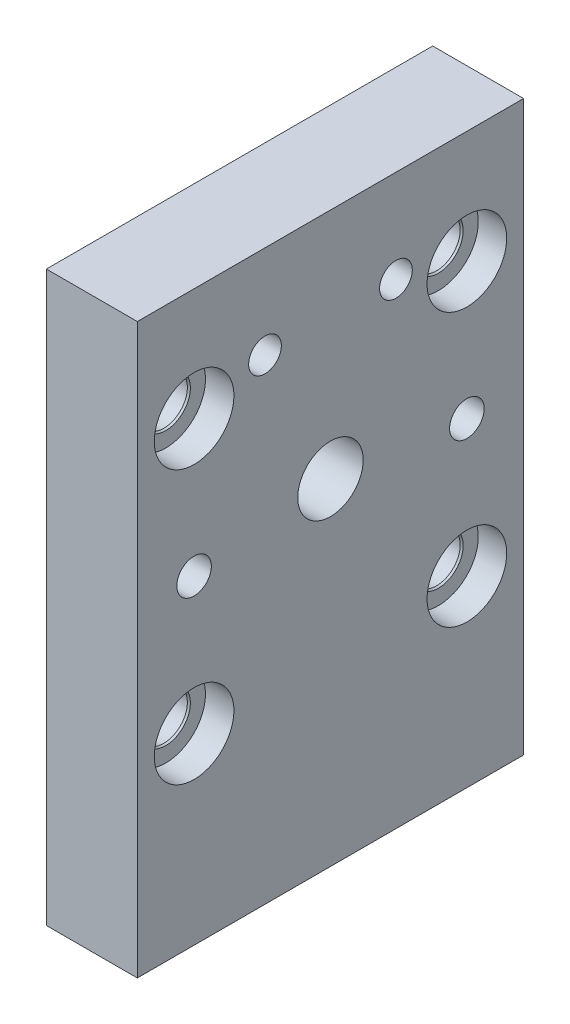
ISO-10303-21;
HEADER;
FILE_DESCRIPTION(('STEP AP214'),'2;1');
FILE_NAME('part.step','',(''),(''),'','','');
FILE_SCHEMA(('AUTOMOTIVE_DESIGN { 1 0 10303 214 1 1 1 1 }'));
ENDSEC;
DATA;
#1=APPLICATION_CONTEXT('core data for automotive mechanical design processes');
#2=APPLICATION_PROTOCOL_DEFINITION('international standard','automotive_design',2000,#1);
#3=PRODUCT_CONTEXT('',#1,'mechanical');
#4=PRODUCT('Part','Part','',(#3));
#5=PRODUCT_RELATED_PRODUCT_CATEGORY('part','',(#4));
#6=PRODUCT_DEFINITION_FORMATION('','',#4);
#7=PRODUCT_DEFINITION_CONTEXT('part definition',#1,'design');
#8=PRODUCT_DEFINITION('design','',#6,#7);
#9=PRODUCT_DEFINITION_SHAPE('','',#8);
#10=(LENGTH_UNIT() NAMED_UNIT(*) SI_UNIT(.MILLI.,.METRE.));
#11=(NAMED_UNIT(*) PLANE_ANGLE_UNIT() SI_UNIT($,.RADIAN.));
#12=(NAMED_UNIT(*) SI_UNIT($,.STERADIAN.) SOLID_ANGLE_UNIT());
#13=UNCERTAINTY_MEASURE_WITH_UNIT(LENGTH_MEASURE(1.E-05),#10,'distance_accuracy_value','');
#14=(GEOMETRIC_REPRESENTATION_CONTEXT(3) GLOBAL_UNCERTAINTY_ASSIGNED_CONTEXT((#13)) GLOBAL_UNIT_ASSIGNED_CONTEXT((#10,
#11,#12)) REPRESENTATION_CONTEXT('',''));
#15=CARTESIAN_POINT('',(0.,0.,0.));
#16=DIRECTION('',(0.,0.,1.));
#17=DIRECTION('',(1.,0.,0.));
#18=AXIS2_PLACEMENT_3D('',#15,#16,#17);
#19=CARTESIAN_POINT('',(0.,0.,13.4874));
#20=DIRECTION('',(1.,0.,0.));
#21=DIRECTION('',(0.,0.,-1.));
#22=AXIS2_PLACEMENT_3D('',#19,#20,#21);
#23=PLANE('',#22);
#24=CARTESIAN_POINT('',(0.,33.2232,-4.572));
#25=DIRECTION('',(1.,0.,0.));
#26=DIRECTION('',(0.,0.,-1.));
#27=AXIS2_PLACEMENT_3D('',#24,#25,#26);
#28=CIRCLE('',#27,1.143);
#29=CARTESIAN_POINT('',(0.,33.2232,-5.715));
#30=VERTEX_POINT('',#29);
#31=EDGE_CURVE('E465',#30,#30,#28,.T.);
#32=ORIENTED_EDGE('',*,*,#31,.T.);
#33=EDGE_LOOP('',(#32));
#34=FACE_BOUND('',#33,.T.);
#35=CARTESIAN_POINT('',(0.,12.8016,-9.525));
#36=DIRECTION('',(-1.,0.,0.));
#37=DIRECTION('',(0.,0.,1.));
#38=AXIS2_PLACEMENT_3D('',#35,#36,#37);
#39=CIRCLE('',#38,1.651);
#40=CARTESIAN_POINT('',(0.,12.8016,-7.874));
#41=VERTEX_POINT('',#40);
#42=EDGE_CURVE('E500',#41,#41,#39,.T.);
#43=ORIENTED_EDGE('',*,*,#42,.F.);
#44=EDGE_LOOP('',(#43));
#45=FACE_BOUND('',#44,.T.);
#46=CARTESIAN_POINT('',(0.,31.8516,9.525));
#47=DIRECTION('',(-1.,0.,0.));
#48=DIRECTION('',(0.,0.,1.));
#49=AXIS2_PLACEMENT_3D('',#46,#47,#48);
#50=CIRCLE('',#49,1.651);
#51=CARTESIAN_POINT('',(0.,31.8516,11.176));
#52=VERTEX_POINT('',#51);
#53=EDGE_CURVE('E528',#52,#52,#50,.T.);
#54=ORIENTED_EDGE('',*,*,#53,.F.);
#55=EDGE_LOOP('',(#54));
#56=FACE_BOUND('',#55,.T.);
#57=CARTESIAN_POINT('',(0.,29.7434,0.));
#58=DIRECTION('',(1.,0.,0.));
#59=DIRECTION('',(0.,0.,-1.));
#60=AXIS2_PLACEMENT_3D('',#57,#58,#59);
#61=CIRCLE('',#60,2.794);
#62=CARTESIAN_POINT('',(0.,29.7434,-2.794));
#63=VERTEX_POINT('',#62);
#64=EDGE_CURVE('E319',#63,#63,#61,.T.);
#65=ORIENTED_EDGE('',*,*,#64,.T.);
#66=EDGE_LOOP('',(#65));
#67=FACE_BOUND('',#66,.T.);
#68=CARTESIAN_POINT('',(0.,22.3266,9.525));
#69=DIRECTION('',(1.,0.,0.));
#70=DIRECTION('',(0.,0.,-1.));
#71=AXIS2_PLACEMENT_3D('',#68,#69,#70);
#72=CIRCLE('',#71,1.2065);
#73=CARTESIAN_POINT('',(0.,22.3266,8.3185));
#74=VERTEX_POINT('',#73);
#75=EDGE_CURVE('E331',#74,#74,#72,.T.);
#76=ORIENTED_EDGE('',*,*,#75,.T.);
#77=EDGE_LOOP('',(#76));
#78=FACE_BOUND('',#77,.T.);
#79=CARTESIAN_POINT('',(0.,22.3266,-9.525));
#80=DIRECTION('',(1.,0.,0.));
#81=DIRECTION('',(0.,0.,-1.));
#82=AXIS2_PLACEMENT_3D('',#79,#80,#81);
#83=CIRCLE('',#82,1.2065);
#84=CARTESIAN_POINT('',(0.,22.3266,-10.7315));
#85=VERTEX_POINT('',#84);
#86=EDGE_CURVE('E343',#85,#85,#83,.T.);
#87=ORIENTED_EDGE('',*,*,#86,.T.);
#88=EDGE_LOOP('',(#87));
#89=FACE_BOUND('',#88,.T.);
#90=DIRECTION('',(0.,-1.,0.));
#91=VECTOR('',#90,1.);
#92=CARTESIAN_POINT('',(0.,39.7002,13.4874));
#93=LINE('',#92,#91);
#94=CARTESIAN_POINT('',(0.,39.7002,13.4874));
#95=VERTEX_POINT('',#94);
#96=CARTESIAN_POINT('',(0.,0.,13.4874));
#97=VERTEX_POINT('',#96);
#98=EDGE_CURVE('E349',#95,#97,#93,.T.);
#99=ORIENTED_EDGE('',*,*,#98,.F.);
#100=DIRECTION('',(0.,0.,1.));
#101=VECTOR('',#100,1.);
#102=CARTESIAN_POINT('',(0.,39.7002,-13.4874));
#103=LINE('',#102,#101);
#104=CARTESIAN_POINT('',(0.,39.7002,-13.4874));
#105=VERTEX_POINT('',#104);
#106=EDGE_CURVE('E356',#105,#95,#103,.T.);
#107=ORIENTED_EDGE('',*,*,#106,.F.);
#108=DIRECTION('',(0.,1.,0.));
#109=VECTOR('',#108,1.);
#110=CARTESIAN_POINT('',(0.,0.,-13.4874));
#111=LINE('',#110,#109);
#112=CARTESIAN_POINT('',(0.,0.,-13.4874));
#113=VERTEX_POINT('',#112);
#114=EDGE_CURVE('E367',#113,#105,#111,.T.);
#115=ORIENTED_EDGE('',*,*,#114,.F.);
#116=DIRECTION('',(0.,0.,-1.));
#117=VECTOR('',#116,1.);
#118=CARTESIAN_POINT('',(0.,0.,13.4874));
#119=LINE('',#118,#117);
#120=EDGE_CURVE('E365',#97,#113,#119,.T.);
#121=ORIENTED_EDGE('',*,*,#120,.F.);
#122=EDGE_LOOP('',(#99,#107,#115,#121));
#123=FACE_BOUND('',#122,.T.);
#124=CARTESIAN_POINT('',(0.,23.4442,0.));
#125=DIRECTION('',(1.,0.,0.));
#126=DIRECTION('',(0.,0.,-1.));
#127=AXIS2_PLACEMENT_3D('',#124,#125,#126);
#128=CIRCLE('',#127,2.286);
#129=CARTESIAN_POINT('',(0.,23.4442,-2.286));
#130=VERTEX_POINT('',#129);
#131=EDGE_CURVE('E337',#130,#130,#128,.T.);
#132=ORIENTED_EDGE('',*,*,#131,.T.);
#133=EDGE_LOOP('',(#132));
#134=FACE_BOUND('',#133,.T.);
#135=CARTESIAN_POINT('',(0.,10.5156,0.));
#136=DIRECTION('',(1.,0.,0.));
#137=DIRECTION('',(0.,0.,-1.));
#138=AXIS2_PLACEMENT_3D('',#135,#136,#137);
#139=CIRCLE('',#138,2.794);
#140=CARTESIAN_POINT('',(0.,10.5156,-2.794));
#141=VERTEX_POINT('',#140);
#142=EDGE_CURVE('E325',#141,#141,#139,.T.);
#143=ORIENTED_EDGE('',*,*,#142,.T.);
#144=EDGE_LOOP('',(#143));
#145=FACE_BOUND('',#144,.T.);
#146=CARTESIAN_POINT('',(0.,36.0934,0.));
#147=DIRECTION('',(1.,0.,0.));
#148=DIRECTION('',(0.,0.,-1.));
#149=AXIS2_PLACEMENT_3D('',#146,#147,#148);
#150=CIRCLE('',#149,2.794);
#151=CARTESIAN_POINT('',(0.,36.0934,-2.794));
#152=VERTEX_POINT('',#151);
#153=EDGE_CURVE('E315',#152,#152,#150,.T.);
#154=ORIENTED_EDGE('',*,*,#153,.T.);
#155=EDGE_LOOP('',(#154));
#156=FACE_BOUND('',#155,.T.);
#157=CARTESIAN_POINT('',(0.,12.8016,9.525));
#158=DIRECTION('',(-1.,0.,0.));
#159=DIRECTION('',(0.,0.,1.));
#160=AXIS2_PLACEMENT_3D('',#157,#158,#159);
#161=CIRCLE('',#160,1.651);
#162=CARTESIAN_POINT('',(0.,12.8016,11.176));
#163=VERTEX_POINT('',#162);
#164=EDGE_CURVE('E513',#163,#163,#161,.T.);
#165=ORIENTED_EDGE('',*,*,#164,.F.);
#166=EDGE_LOOP('',(#165));
#167=FACE_BOUND('',#166,.T.);
#168=CARTESIAN_POINT('',(0.,31.8516,-9.525));
#169=DIRECTION('',(-1.,0.,0.));
#170=DIRECTION('',(0.,0.,1.));
#171=AXIS2_PLACEMENT_3D('',#168,#169,#170);
#172=CIRCLE('',#171,1.651);
#173=CARTESIAN_POINT('',(0.,31.8516,-7.874));
#174=VERTEX_POINT('',#173);
#175=EDGE_CURVE('E485',#174,#174,#172,.T.);
#176=ORIENTED_EDGE('',*,*,#175,.F.);
#177=EDGE_LOOP('',(#176));
#178=FACE_BOUND('',#177,.T.);
#179=CARTESIAN_POINT('',(0.,33.2232,4.572));
#180=DIRECTION('',(1.,0.,0.));
#181=DIRECTION('',(0.,0.,-1.));
#182=AXIS2_PLACEMENT_3D('',#179,#180,#181);
#183=CIRCLE('',#182,1.143);
#184=CARTESIAN_POINT('',(0.,33.2232,3.429));
#185=VERTEX_POINT('',#184);
#186=EDGE_CURVE('E466',#185,#185,#183,.T.);
#187=ORIENTED_EDGE('',*,*,#186,.T.);
#188=EDGE_LOOP('',(#187));
#189=FACE_BOUND('',#188,.T.);
#190=ADVANCED_FACE('F33',(#34,#45,#56,#67,#78,#89,#123,#134,#145,#156,#167,#178,#189),#23,.F.);
#191=CARTESIAN_POINT('',(6.35,0.,13.4874));
#192=DIRECTION('',(1.,0.,0.));
#193=DIRECTION('',(0.,0.,-1.));
#194=AXIS2_PLACEMENT_3D('',#191,#192,#193);
#195=PLANE('',#194);
#196=CARTESIAN_POINT('',(6.35,33.2232,-4.572));
#197=DIRECTION('',(1.,0.,0.));
#198=DIRECTION('',(0.,0.,-1.));
#199=AXIS2_PLACEMENT_3D('',#196,#197,#198);
#200=CIRCLE('',#199,1.143);
#201=CARTESIAN_POINT('',(6.35,33.2232,-5.715));
#202=VERTEX_POINT('',#201);
#203=EDGE_CURVE('E468',#202,#202,#200,.T.);
#204=ORIENTED_EDGE('',*,*,#203,.F.);
#205=EDGE_LOOP('',(#204));
#206=FACE_BOUND('',#205,.T.);
#207=CARTESIAN_POINT('',(6.35,12.8016,-9.525));
#208=DIRECTION('',(-1.,0.,0.));
#209=DIRECTION('',(0.,0.,1.));
#210=AXIS2_PLACEMENT_3D('',#207,#208,#209);
#211=CIRCLE('',#210,2.7813);
#212=CARTESIAN_POINT('',(6.35,12.8016,-6.7437));
#213=VERTEX_POINT('',#212);
#214=EDGE_CURVE('E488',#213,#213,#211,.T.);
#215=ORIENTED_EDGE('',*,*,#214,.T.);
#216=EDGE_LOOP('',(#215));
#217=FACE_BOUND('',#216,.T.);
#218=CARTESIAN_POINT('',(6.35,31.8516,9.525));
#219=DIRECTION('',(-1.,0.,0.));
#220=DIRECTION('',(0.,0.,1.));
#221=AXIS2_PLACEMENT_3D('',#218,#219,#220);
#222=CIRCLE('',#221,2.7813);
#223=CARTESIAN_POINT('',(6.35,31.8516,12.3063));
#224=VERTEX_POINT('',#223);
#225=EDGE_CURVE('E516',#224,#224,#222,.T.);
#226=ORIENTED_EDGE('',*,*,#225,.T.);
#227=EDGE_LOOP('',(#226));
#228=FACE_BOUND('',#227,.T.);
#229=CARTESIAN_POINT('',(6.35,23.4442,0.));
#230=DIRECTION('',(1.,0.,0.));
#231=DIRECTION('',(0.,0.,-1.));
#232=AXIS2_PLACEMENT_3D('',#229,#230,#231);
#233=CIRCLE('',#232,2.286);
#234=CARTESIAN_POINT('',(6.35,23.4442,-2.286));
#235=VERTEX_POINT('',#234);
#236=EDGE_CURVE('E340',#235,#235,#233,.T.);
#237=ORIENTED_EDGE('',*,*,#236,.F.);
#238=EDGE_LOOP('',(#237));
#239=FACE_BOUND('',#238,.T.);
#240=DIRECTION('',(0.,-1.,0.));
#241=VECTOR('',#240,1.);
#242=CARTESIAN_POINT('',(6.35,39.7002,13.4874));
#243=LINE('',#242,#241);
#244=CARTESIAN_POINT('',(6.35,39.7002,13.4874));
#245=VERTEX_POINT('',#244);
#246=CARTESIAN_POINT('',(6.35,0.,13.4874));
#247=VERTEX_POINT('',#246);
#248=EDGE_CURVE('E352',#245,#247,#243,.T.);
#249=ORIENTED_EDGE('',*,*,#248,.T.);
#250=DIRECTION('',(0.,0.,-1.));
#251=VECTOR('',#250,1.);
#252=CARTESIAN_POINT('',(6.35,0.,13.4874));
#253=LINE('',#252,#251);
#254=CARTESIAN_POINT('',(6.35,0.,-13.4874));
#255=VERTEX_POINT('',#254);
#256=EDGE_CURVE('E355',#247,#255,#253,.T.);
#257=ORIENTED_EDGE('',*,*,#256,.T.);
#258=DIRECTION('',(0.,1.,0.));
#259=VECTOR('',#258,1.);
#260=CARTESIAN_POINT('',(6.35,0.,-13.4874));
#261=LINE('',#260,#259);
#262=CARTESIAN_POINT('',(6.35,39.7002,-13.4874));
#263=VERTEX_POINT('',#262);
#264=EDGE_CURVE('E358',#255,#263,#261,.T.);
#265=ORIENTED_EDGE('',*,*,#264,.T.);
#266=DIRECTION('',(0.,0.,1.));
#267=VECTOR('',#266,1.);
#268=CARTESIAN_POINT('',(6.35,39.7002,-13.4874));
#269=LINE('',#268,#267);
#270=EDGE_CURVE('E360',#263,#245,#269,.T.);
#271=ORIENTED_EDGE('',*,*,#270,.T.);
#272=EDGE_LOOP('',(#249,#257,#265,#271));
#273=FACE_BOUND('',#272,.T.);
#274=CARTESIAN_POINT('',(6.35,22.3266,-9.525));
#275=DIRECTION('',(1.,0.,0.));
#276=DIRECTION('',(0.,0.,-1.));
#277=AXIS2_PLACEMENT_3D('',#274,#275,#276);
#278=CIRCLE('',#277,1.2065);
#279=CARTESIAN_POINT('',(6.35,22.3266,-10.7315));
#280=VERTEX_POINT('',#279);
#281=EDGE_CURVE('E346',#280,#280,#278,.T.);
#282=ORIENTED_EDGE('',*,*,#281,.F.);
#283=EDGE_LOOP('',(#282));
#284=FACE_BOUND('',#283,.T.);
#285=CARTESIAN_POINT('',(6.35,22.3266,9.525));
#286=DIRECTION('',(1.,0.,0.));
#287=DIRECTION('',(0.,0.,-1.));
#288=AXIS2_PLACEMENT_3D('',#285,#286,#287);
#289=CIRCLE('',#288,1.2065);
#290=CARTESIAN_POINT('',(6.35,22.3266,8.3185));
#291=VERTEX_POINT('',#290);
#292=EDGE_CURVE('E334',#291,#291,#289,.T.);
#293=ORIENTED_EDGE('',*,*,#292,.F.);
#294=EDGE_LOOP('',(#293));
#295=FACE_BOUND('',#294,.T.);
#296=CARTESIAN_POINT('',(6.35,12.8016,9.525));
#297=DIRECTION('',(-1.,0.,0.));
#298=DIRECTION('',(0.,0.,1.));
#299=AXIS2_PLACEMENT_3D('',#296,#297,#298);
#300=CIRCLE('',#299,2.7813);
#301=CARTESIAN_POINT('',(6.35,12.8016,12.3063));
#302=VERTEX_POINT('',#301);
#303=EDGE_CURVE('E456',#302,#302,#300,.T.);
#304=ORIENTED_EDGE('',*,*,#303,.T.);
#305=EDGE_LOOP('',(#304));
#306=FACE_BOUND('',#305,.T.);
#307=CARTESIAN_POINT('',(6.35,31.8516,-9.525));
#308=DIRECTION('',(-1.,0.,0.));
#309=DIRECTION('',(0.,0.,1.));
#310=AXIS2_PLACEMENT_3D('',#307,#308,#309);
#311=CIRCLE('',#310,2.7813);
#312=CARTESIAN_POINT('',(6.35,31.8516,-6.7437));
#313=VERTEX_POINT('',#312);
#314=EDGE_CURVE('E460',#313,#313,#311,.T.);
#315=ORIENTED_EDGE('',*,*,#314,.T.);
#316=EDGE_LOOP('',(#315));
#317=FACE_BOUND('',#316,.T.);
#318=CARTESIAN_POINT('',(6.35,33.2232,4.572));
#319=DIRECTION('',(1.,0.,0.));
#320=DIRECTION('',(0.,0.,-1.));
#321=AXIS2_PLACEMENT_3D('',#318,#319,#320);
#322=CIRCLE('',#321,1.143);
#323=CARTESIAN_POINT('',(6.35,33.2232,3.429));
#324=VERTEX_POINT('',#323);
#325=EDGE_CURVE('E463',#324,#324,#322,.T.);
#326=ORIENTED_EDGE('',*,*,#325,.F.);
#327=EDGE_LOOP('',(#326));
#328=FACE_BOUND('',#327,.T.);
#329=ADVANCED_FACE('F407',(#206,#217,#228,#239,#273,#284,#295,#306,#317,#328),#195,.T.);
#330=CARTESIAN_POINT('',(0.,29.7434,0.));
#331=DIRECTION('',(1.,0.,0.));
#332=DIRECTION('',(0.,0.,-1.));
#333=AXIS2_PLACEMENT_3D('',#330,#331,#332);
#334=PLANE('',#333);
#335=CARTESIAN_POINT('',(0.,29.7434,0.));
#336=DIRECTION('',(-1.,0.,0.));
#337=DIRECTION('',(0.,0.,1.));
#338=AXIS2_PLACEMENT_3D('',#335,#336,#337);
#339=CIRCLE('',#338,2.032);
#340=CARTESIAN_POINT('',(0.,29.7434,2.032));
#341=VERTEX_POINT('',#340);
#342=EDGE_CURVE('E300',#341,#341,#339,.T.);
#343=ORIENTED_EDGE('',*,*,#342,.T.);
#344=EDGE_LOOP('',(#343));
#345=FACE_BOUND('',#344,.T.);
#346=DIRECTION('',(0.,-0.5,0.866025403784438));
#347=VECTOR('',#346,1.);
#348=CARTESIAN_POINT('',(0.,31.5764871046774,2.28170347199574E-13));
#349=LINE('',#348,#347);
#350=CARTESIAN_POINT('',(0.,31.5764871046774,2.28224557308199E-13));
#351=VERTEX_POINT('',#350);
#352=CARTESIAN_POINT('',(0.,30.659943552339,1.5875));
#353=VERTEX_POINT('',#352);
#354=EDGE_CURVE('E48',#351,#353,#349,.T.);
#355=ORIENTED_EDGE('',*,*,#354,.T.);
#356=DIRECTION('',(0.,-1.,0.));
#357=VECTOR('',#356,1.);
#358=CARTESIAN_POINT('',(0.,30.659943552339,1.5875));
#359=LINE('',#358,#357);
#360=CARTESIAN_POINT('',(0.,28.8268564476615,1.5875));
#361=VERTEX_POINT('',#360);
#362=EDGE_CURVE('E204',#353,#361,#359,.T.);
#363=ORIENTED_EDGE('',*,*,#362,.T.);
#364=DIRECTION('',(0.,-0.500000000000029,-0.866025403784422));
#365=VECTOR('',#364,1.);
#366=CARTESIAN_POINT('',(0.,28.8268564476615,1.5875));
#367=LINE('',#366,#365);
#368=CARTESIAN_POINT('',(0.,27.9103128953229,0.));
#369=VERTEX_POINT('',#368);
#370=EDGE_CURVE('E540',#361,#369,#367,.T.);
#371=ORIENTED_EDGE('',*,*,#370,.T.);
#372=DIRECTION('',(0.,0.500000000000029,-0.866025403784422));
#373=VECTOR('',#372,1.);
#374=CARTESIAN_POINT('',(0.,27.9103128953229,0.));
#375=LINE('',#374,#373);
#376=CARTESIAN_POINT('',(0.,28.8268564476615,-1.5875));
#377=VERTEX_POINT('',#376);
#378=EDGE_CURVE('E543',#369,#377,#375,.T.);
#379=ORIENTED_EDGE('',*,*,#378,.T.);
#380=DIRECTION('',(0.,1.,0.));
#381=VECTOR('',#380,1.);
#382=CARTESIAN_POINT('',(0.,28.8268564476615,-1.5875));
#383=LINE('',#382,#381);
#384=CARTESIAN_POINT('',(0.,30.659943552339,-1.5875));
#385=VERTEX_POINT('',#384);
#386=EDGE_CURVE('E546',#377,#385,#383,.T.);
#387=ORIENTED_EDGE('',*,*,#386,.T.);
#388=DIRECTION('',(0.,0.499999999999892,0.866025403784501));
#389=VECTOR('',#388,1.);
#390=CARTESIAN_POINT('',(0.,30.659943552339,-1.5875));
#391=LINE('',#390,#389);
#392=EDGE_CURVE('E200',#385,#351,#391,.T.);
#393=ORIENTED_EDGE('',*,*,#392,.T.);
#394=EDGE_LOOP('',(#355,#363,#371,#379,#387,#393));
#395=FACE_BOUND('',#394,.T.);
#396=ADVANCED_FACE('F413',(#345,#395),#334,.F.);
#397=CARTESIAN_POINT('',(0.,36.0934,0.));
#398=DIRECTION('',(1.,0.,0.));
#399=DIRECTION('',(0.,0.,-1.));
#400=AXIS2_PLACEMENT_3D('',#397,#398,#399);
#401=PLANE('',#400);
#402=CARTESIAN_POINT('',(0.,36.0934,0.));
#403=DIRECTION('',(-1.,0.,0.));
#404=DIRECTION('',(0.,0.,1.));
#405=AXIS2_PLACEMENT_3D('',#402,#403,#404);
#406=CIRCLE('',#405,2.03200000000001);
#407=CARTESIAN_POINT('',(0.,36.0934,2.03200000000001));
#408=VERTEX_POINT('',#407);
#409=EDGE_CURVE('E306',#408,#408,#406,.T.);
#410=ORIENTED_EDGE('',*,*,#409,.T.);
#411=EDGE_LOOP('',(#410));
#412=FACE_BOUND('',#411,.T.);
#413=DIRECTION('',(0.,-0.499999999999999,0.866025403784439));
#414=VECTOR('',#413,1.);
#415=CARTESIAN_POINT('',(0.,37.9264871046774,2.2963402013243E-13));
#416=LINE('',#415,#414);
#417=CARTESIAN_POINT('',(0.,37.9264871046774,2.29742440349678E-13));
#418=VERTEX_POINT('',#417);
#419=CARTESIAN_POINT('',(0.,37.009943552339,1.5875));
#420=VERTEX_POINT('',#419);
#421=EDGE_CURVE('E56',#418,#420,#416,.T.);
#422=ORIENTED_EDGE('',*,*,#421,.T.);
#423=DIRECTION('',(0.,-1.,0.));
#424=VECTOR('',#423,1.);
#425=CARTESIAN_POINT('',(0.,37.009943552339,1.5875));
#426=LINE('',#425,#424);
#427=CARTESIAN_POINT('',(0.,35.1768564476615,1.5875));
#428=VERTEX_POINT('',#427);
#429=EDGE_CURVE('E207',#420,#428,#426,.T.);
#430=ORIENTED_EDGE('',*,*,#429,.T.);
#431=DIRECTION('',(0.,-0.500000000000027,-0.866025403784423));
#432=VECTOR('',#431,1.);
#433=CARTESIAN_POINT('',(0.,35.1768564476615,1.5875));
#434=LINE('',#433,#432);
#435=CARTESIAN_POINT('',(0.,34.2603128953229,0.));
#436=VERTEX_POINT('',#435);
#437=EDGE_CURVE('E230',#428,#436,#434,.T.);
#438=ORIENTED_EDGE('',*,*,#437,.T.);
#439=DIRECTION('',(0.,0.500000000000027,-0.866025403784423));
#440=VECTOR('',#439,1.);
#441=CARTESIAN_POINT('',(0.,34.2603128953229,0.));
#442=LINE('',#441,#440);
#443=CARTESIAN_POINT('',(0.,35.1768564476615,-1.5875));
#444=VERTEX_POINT('',#443);
#445=EDGE_CURVE('E233',#436,#444,#442,.T.);
#446=ORIENTED_EDGE('',*,*,#445,.T.);
#447=DIRECTION('',(0.,1.,0.));
#448=VECTOR('',#447,1.);
#449=CARTESIAN_POINT('',(0.,35.1768564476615,-1.5875));
#450=LINE('',#449,#448);
#451=CARTESIAN_POINT('',(0.,37.009943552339,-1.5875));
#452=VERTEX_POINT('',#451);
#453=EDGE_CURVE('E236',#444,#452,#450,.T.);
#454=ORIENTED_EDGE('',*,*,#453,.T.);
#455=DIRECTION('',(0.,0.499999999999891,0.866025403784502));
#456=VECTOR('',#455,1.);
#457=CARTESIAN_POINT('',(0.,37.009943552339,-1.5875));
#458=LINE('',#457,#456);
#459=EDGE_CURVE('E217',#452,#418,#458,.T.);
#460=ORIENTED_EDGE('',*,*,#459,.T.);
#461=EDGE_LOOP('',(#422,#430,#438,#446,#454,#460));
#462=FACE_BOUND('',#461,.T.);
#463=ADVANCED_FACE('F653',(#412,#462),#401,.F.);
#464=CARTESIAN_POINT('',(0.,10.5156,0.));
#465=DIRECTION('',(1.,0.,0.));
#466=DIRECTION('',(0.,0.,-1.));
#467=AXIS2_PLACEMENT_3D('',#464,#465,#466);
#468=PLANE('',#467);
#469=CARTESIAN_POINT('',(0.,10.5156,0.));
#470=DIRECTION('',(-1.,0.,0.));
#471=DIRECTION('',(0.,0.,1.));
#472=AXIS2_PLACEMENT_3D('',#469,#470,#471);
#473=CIRCLE('',#472,2.032);
#474=CARTESIAN_POINT('',(0.,10.5156,2.032));
#475=VERTEX_POINT('',#474);
#476=EDGE_CURVE('E312',#475,#475,#473,.T.);
#477=ORIENTED_EDGE('',*,*,#476,.T.);
#478=EDGE_LOOP('',(#477));
#479=FACE_BOUND('',#478,.T.);
#480=DIRECTION('',(0.,-0.5,0.866025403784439));
#481=VECTOR('',#480,1.);
#482=CARTESIAN_POINT('',(0.,12.3486871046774,2.2963402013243E-13));
#483=LINE('',#482,#481);
#484=CARTESIAN_POINT('',(0.,12.3486871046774,2.2963402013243E-13));
#485=VERTEX_POINT('',#484);
#486=CARTESIAN_POINT('',(0.,11.432143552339,1.5875));
#487=VERTEX_POINT('',#486);
#488=EDGE_CURVE('E252',#485,#487,#483,.T.);
#489=ORIENTED_EDGE('',*,*,#488,.T.);
#490=DIRECTION('',(0.,-1.,0.));
#491=VECTOR('',#490,1.);
#492=CARTESIAN_POINT('',(0.,11.432143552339,1.5875));
#493=LINE('',#492,#491);
#494=CARTESIAN_POINT('',(0.,9.5990564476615,1.5875));
#495=VERTEX_POINT('',#494);
#496=EDGE_CURVE('E270',#487,#495,#493,.T.);
#497=ORIENTED_EDGE('',*,*,#496,.T.);
#498=DIRECTION('',(0.,-0.500000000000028,-0.866025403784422));
#499=VECTOR('',#498,1.);
#500=CARTESIAN_POINT('',(0.,9.5990564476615,1.5875));
#501=LINE('',#500,#499);
#502=CARTESIAN_POINT('',(0.,8.6825128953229,0.));
#503=VERTEX_POINT('',#502);
#504=EDGE_CURVE('E273',#495,#503,#501,.T.);
#505=ORIENTED_EDGE('',*,*,#504,.T.);
#506=DIRECTION('',(0.,0.500000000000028,-0.866025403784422));
#507=VECTOR('',#506,1.);
#508=CARTESIAN_POINT('',(0.,8.6825128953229,0.));
#509=LINE('',#508,#507);
#510=CARTESIAN_POINT('',(0.,9.5990564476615,-1.5875));
#511=VERTEX_POINT('',#510);
#512=EDGE_CURVE('E276',#503,#511,#509,.T.);
#513=ORIENTED_EDGE('',*,*,#512,.T.);
#514=DIRECTION('',(0.,1.,0.));
#515=VECTOR('',#514,1.);
#516=CARTESIAN_POINT('',(0.,9.5990564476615,-1.5875));
#517=LINE('',#516,#515);
#518=CARTESIAN_POINT('',(0.,11.432143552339,-1.5875));
#519=VERTEX_POINT('',#518);
#520=EDGE_CURVE('E279',#511,#519,#517,.T.);
#521=ORIENTED_EDGE('',*,*,#520,.T.);
#522=DIRECTION('',(0.,0.499999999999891,0.866025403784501));
#523=VECTOR('',#522,1.);
#524=CARTESIAN_POINT('',(0.,11.432143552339,-1.5875));
#525=LINE('',#524,#523);
#526=EDGE_CURVE('E257',#519,#485,#525,.T.);
#527=ORIENTED_EDGE('',*,*,#526,.T.);
#528=EDGE_LOOP('',(#489,#497,#505,#513,#521,#527));
#529=FACE_BOUND('',#528,.T.);
#530=ADVANCED_FACE('F400',(#479,#529),#468,.F.);
#531=CARTESIAN_POINT('',(3.175,29.7434,0.));
#532=DIRECTION('',(1.,0.,0.));
#533=DIRECTION('',(0.,0.,-1.));
#534=AXIS2_PLACEMENT_3D('',#531,#532,#533);
#535=PLANE('',#534);
#536=CARTESIAN_POINT('',(3.175,29.7434,0.));
#537=DIRECTION('',(1.,0.,0.));
#538=DIRECTION('',(0.,0.,-1.));
#539=AXIS2_PLACEMENT_3D('',#536,#537,#538);
#540=CIRCLE('',#539,2.794);
#541=CARTESIAN_POINT('',(3.175,29.7434,-2.794));
#542=VERTEX_POINT('',#541);
#543=EDGE_CURVE('E322',#542,#542,#540,.T.);
#544=ORIENTED_EDGE('',*,*,#543,.F.);
#545=EDGE_LOOP('',(#544));
#546=FACE_BOUND('',#545,.T.);
#547=CARTESIAN_POINT('',(3.175,29.7434,0.));
#548=DIRECTION('',(1.,0.,0.));
#549=DIRECTION('',(0.,0.,-1.));
#550=AXIS2_PLACEMENT_3D('',#547,#548,#549);
#551=CIRCLE('',#550,2.54);
#552=CARTESIAN_POINT('',(3.175,29.7434,-2.54));
#553=VERTEX_POINT('',#552);
#554=EDGE_CURVE('E11',#553,#553,#551,.F.);
#555=ORIENTED_EDGE('',*,*,#554,.F.);
#556=EDGE_LOOP('',(#555));
#557=FACE_BOUND('',#556,.T.);
#558=ADVANCED_FACE('F391',(#546,#557),#535,.F.);
#559=CARTESIAN_POINT('',(3.175,36.0934,0.));
#560=DIRECTION('',(1.,0.,0.));
#561=DIRECTION('',(0.,0.,-1.));
#562=AXIS2_PLACEMENT_3D('',#559,#560,#561);
#563=PLANE('',#562);
#564=CARTESIAN_POINT('',(3.175,36.0934,0.));
#565=DIRECTION('',(1.,0.,0.));
#566=DIRECTION('',(0.,0.,-1.));
#567=AXIS2_PLACEMENT_3D('',#564,#565,#566);
#568=CIRCLE('',#567,2.794);
#569=CARTESIAN_POINT('',(3.175,36.0934,-2.794));
#570=VERTEX_POINT('',#569);
#571=EDGE_CURVE('E316',#570,#570,#568,.T.);
#572=ORIENTED_EDGE('',*,*,#571,.F.);
#573=EDGE_LOOP('',(#572));
#574=FACE_BOUND('',#573,.T.);
#575=CARTESIAN_POINT('',(3.175,36.0934,0.));
#576=DIRECTION('',(1.,0.,0.));
#577=DIRECTION('',(0.,0.,-1.));
#578=AXIS2_PLACEMENT_3D('',#575,#576,#577);
#579=CIRCLE('',#578,2.54);
#580=CARTESIAN_POINT('',(3.175,36.0934,-2.54));
#581=VERTEX_POINT('',#580);
#582=EDGE_CURVE('E41',#581,#581,#579,.F.);
#583=ORIENTED_EDGE('',*,*,#582,.F.);
#584=EDGE_LOOP('',(#583));
#585=FACE_BOUND('',#584,.T.);
#586=ADVANCED_FACE('F388',(#574,#585),#563,.F.);
#587=CARTESIAN_POINT('',(3.175,10.5156,0.));
#588=DIRECTION('',(1.,0.,0.));
#589=DIRECTION('',(0.,0.,-1.));
#590=AXIS2_PLACEMENT_3D('',#587,#588,#589);
#591=PLANE('',#590);
#592=CARTESIAN_POINT('',(3.175,10.5156,0.));
#593=DIRECTION('',(1.,0.,0.));
#594=DIRECTION('',(0.,0.,-1.));
#595=AXIS2_PLACEMENT_3D('',#592,#593,#594);
#596=CIRCLE('',#595,2.794);
#597=CARTESIAN_POINT('',(3.175,10.5156,-2.794));
#598=VERTEX_POINT('',#597);
#599=EDGE_CURVE('E328',#598,#598,#596,.T.);
#600=ORIENTED_EDGE('',*,*,#599,.F.);
#601=EDGE_LOOP('',(#600));
#602=FACE_BOUND('',#601,.T.);
#603=CARTESIAN_POINT('',(3.175,10.5156,0.));
#604=DIRECTION('',(1.,0.,0.));
#605=DIRECTION('',(0.,0.,-1.));
#606=AXIS2_PLACEMENT_3D('',#603,#604,#605);
#607=CIRCLE('',#606,2.54);
#608=CARTESIAN_POINT('',(3.175,10.5156,-2.54));
#609=VERTEX_POINT('',#608);
#610=EDGE_CURVE('E381',#609,#609,#607,.F.);
#611=ORIENTED_EDGE('',*,*,#610,.F.);
#612=EDGE_LOOP('',(#611));
#613=FACE_BOUND('',#612,.T.);
#614=ADVANCED_FACE('F390',(#602,#613),#591,.F.);
#615=CARTESIAN_POINT('',(6.35,39.7002,13.4874));
#616=DIRECTION('',(0.,0.,-1.));
#617=DIRECTION('',(-1.,0.,0.));
#618=AXIS2_PLACEMENT_3D('',#615,#616,#617);
#619=PLANE('',#618);
#620=ORIENTED_EDGE('',*,*,#98,.T.);
#621=DIRECTION('',(-1.,0.,0.));
#622=VECTOR('',#621,1.);
#623=CARTESIAN_POINT('',(6.35,0.,13.4874));
#624=LINE('',#623,#622);
#625=EDGE_CURVE('E378',#247,#97,#624,.T.);
#626=ORIENTED_EDGE('',*,*,#625,.F.);
#627=ORIENTED_EDGE('',*,*,#248,.F.);
#628=DIRECTION('',(-1.,0.,0.));
#629=VECTOR('',#628,1.);
#630=CARTESIAN_POINT('',(6.35,39.7002,13.4874));
#631=LINE('',#630,#629);
#632=EDGE_CURVE('E362',#245,#95,#631,.T.);
#633=ORIENTED_EDGE('',*,*,#632,.T.);
#634=EDGE_LOOP('',(#620,#626,#627,#633));
#635=FACE_BOUND('',#634,.T.);
#636=ADVANCED_FACE('F35',(#635),#619,.F.);
#637=CARTESIAN_POINT('',(6.35,0.,13.4874));
#638=DIRECTION('',(0.,1.,0.));
#639=DIRECTION('',(0.,0.,1.));
#640=AXIS2_PLACEMENT_3D('',#637,#638,#639);
#641=PLANE('',#640);
#642=ORIENTED_EDGE('',*,*,#120,.T.);
#643=DIRECTION('',(-1.,0.,0.));
#644=VECTOR('',#643,1.);
#645=CARTESIAN_POINT('',(6.35,0.,-13.4874));
#646=LINE('',#645,#644);
#647=EDGE_CURVE('E375',#255,#113,#646,.T.);
#648=ORIENTED_EDGE('',*,*,#647,.F.);
#649=ORIENTED_EDGE('',*,*,#256,.F.);
#650=ORIENTED_EDGE('',*,*,#625,.T.);
#651=EDGE_LOOP('',(#642,#648,#649,#650));
#652=FACE_BOUND('',#651,.T.);
#653=ADVANCED_FACE('F427',(#652),#641,.F.);
#654=CARTESIAN_POINT('',(6.35,0.,-13.4874));
#655=DIRECTION('',(0.,0.,1.));
#656=DIRECTION('',(1.,0.,0.));
#657=AXIS2_PLACEMENT_3D('',#654,#655,#656);
#658=PLANE('',#657);
#659=ORIENTED_EDGE('',*,*,#114,.T.);
#660=DIRECTION('',(-1.,0.,0.));
#661=VECTOR('',#660,1.);
#662=CARTESIAN_POINT('',(6.35,39.7002,-13.4874));
#663=LINE('',#662,#661);
#664=EDGE_CURVE('E372',#263,#105,#663,.T.);
#665=ORIENTED_EDGE('',*,*,#664,.F.);
#666=ORIENTED_EDGE('',*,*,#264,.F.);
#667=ORIENTED_EDGE('',*,*,#647,.T.);
#668=EDGE_LOOP('',(#659,#665,#666,#667));
#669=FACE_BOUND('',#668,.T.);
#670=ADVANCED_FACE('F424',(#669),#658,.F.);
#671=CARTESIAN_POINT('',(6.35,39.7002,-13.4874));
#672=DIRECTION('',(0.,-1.,0.));
#673=DIRECTION('',(0.,0.,-1.));
#674=AXIS2_PLACEMENT_3D('',#671,#672,#673);
#675=PLANE('',#674);
#676=ORIENTED_EDGE('',*,*,#106,.T.);
#677=ORIENTED_EDGE('',*,*,#632,.F.);
#678=ORIENTED_EDGE('',*,*,#270,.F.);
#679=ORIENTED_EDGE('',*,*,#664,.T.);
#680=EDGE_LOOP('',(#676,#677,#678,#679));
#681=FACE_BOUND('',#680,.T.);
#682=ADVANCED_FACE('F420',(#681),#675,.F.);
#683=CARTESIAN_POINT('',(6.35,22.3266,-9.525));
#684=DIRECTION('',(-1.,0.,0.));
#685=DIRECTION('',(0.,0.,1.));
#686=AXIS2_PLACEMENT_3D('',#683,#684,#685);
#687=CYLINDRICAL_SURFACE('',#686,1.2065);
#688=ORIENTED_EDGE('',*,*,#281,.T.);
#689=EDGE_LOOP('',(#688));
#690=FACE_BOUND('',#689,.T.);
#691=ORIENTED_EDGE('',*,*,#86,.F.);
#692=EDGE_LOOP('',(#691));
#693=FACE_BOUND('',#692,.T.);
#694=ADVANCED_FACE('F423',(#690,#693),#687,.F.);
#695=CARTESIAN_POINT('',(6.35,23.4442,0.));
#696=DIRECTION('',(-1.,0.,0.));
#697=DIRECTION('',(0.,0.,1.));
#698=AXIS2_PLACEMENT_3D('',#695,#696,#697);
#699=CYLINDRICAL_SURFACE('',#698,2.286);
#700=ORIENTED_EDGE('',*,*,#236,.T.);
#701=EDGE_LOOP('',(#700));
#702=FACE_BOUND('',#701,.T.);
#703=ORIENTED_EDGE('',*,*,#131,.F.);
#704=EDGE_LOOP('',(#703));
#705=FACE_BOUND('',#704,.T.);
#706=ADVANCED_FACE('F1064',(#702,#705),#699,.F.);
#707=CARTESIAN_POINT('',(6.35,22.3266,9.525));
#708=DIRECTION('',(-1.,0.,0.));
#709=DIRECTION('',(0.,0.,1.));
#710=AXIS2_PLACEMENT_3D('',#707,#708,#709);
#711=CYLINDRICAL_SURFACE('',#710,1.2065);
#712=ORIENTED_EDGE('',*,*,#292,.T.);
#713=EDGE_LOOP('',(#712));
#714=FACE_BOUND('',#713,.T.);
#715=ORIENTED_EDGE('',*,*,#75,.F.);
#716=EDGE_LOOP('',(#715));
#717=FACE_BOUND('',#716,.T.);
#718=ADVANCED_FACE('F1067',(#714,#717),#711,.F.);
#719=CARTESIAN_POINT('',(3.175,10.5156,0.));
#720=DIRECTION('',(-1.,0.,0.));
#721=DIRECTION('',(0.,0.,1.));
#722=AXIS2_PLACEMENT_3D('',#719,#720,#721);
#723=CYLINDRICAL_SURFACE('',#722,2.794);
#724=ORIENTED_EDGE('',*,*,#599,.T.);
#725=EDGE_LOOP('',(#724));
#726=FACE_BOUND('',#725,.T.);
#727=ORIENTED_EDGE('',*,*,#142,.F.);
#728=EDGE_LOOP('',(#727));
#729=FACE_BOUND('',#728,.T.);
#730=ADVANCED_FACE('F1099',(#726,#729),#723,.F.);
#731=CARTESIAN_POINT('',(3.175,29.7434,0.));
#732=DIRECTION('',(-1.,0.,0.));
#733=DIRECTION('',(0.,0.,1.));
#734=AXIS2_PLACEMENT_3D('',#731,#732,#733);
#735=CYLINDRICAL_SURFACE('',#734,2.794);
#736=ORIENTED_EDGE('',*,*,#543,.T.);
#737=EDGE_LOOP('',(#736));
#738=FACE_BOUND('',#737,.T.);
#739=ORIENTED_EDGE('',*,*,#64,.F.);
#740=EDGE_LOOP('',(#739));
#741=FACE_BOUND('',#740,.T.);
#742=ADVANCED_FACE('F1094',(#738,#741),#735,.F.);
#743=CARTESIAN_POINT('',(3.175,36.0934,0.));
#744=DIRECTION('',(-1.,0.,0.));
#745=DIRECTION('',(0.,0.,1.));
#746=AXIS2_PLACEMENT_3D('',#743,#744,#745);
#747=CYLINDRICAL_SURFACE('',#746,2.794);
#748=ORIENTED_EDGE('',*,*,#571,.T.);
#749=EDGE_LOOP('',(#748));
#750=FACE_BOUND('',#749,.T.);
#751=ORIENTED_EDGE('',*,*,#153,.F.);
#752=EDGE_LOOP('',(#751));
#753=FACE_BOUND('',#752,.T.);
#754=ADVANCED_FACE('F671',(#750,#753),#747,.F.);
#755=CARTESIAN_POINT('',(0.507999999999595,10.5156,0.));
#756=DIRECTION('',(-1.,0.,0.));
#757=DIRECTION('',(0.,0.,1.));
#758=AXIS2_PLACEMENT_3D('',#755,#756,#757);
#759=TOROIDAL_SURFACE('',#758,2.03200000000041,0.507999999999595);
#760=ORIENTED_EDGE('',*,*,#476,.F.);
#761=EDGE_LOOP('',(#760));
#762=FACE_BOUND('',#761,.T.);
#763=CARTESIAN_POINT('',(0.508,10.5156,0.));
#764=DIRECTION('',(-1.,0.,0.));
#765=DIRECTION('',(0.,0.,1.));
#766=AXIS2_PLACEMENT_3D('',#763,#764,#765);
#767=CIRCLE('',#766,2.54);
#768=CARTESIAN_POINT('',(0.508,10.5156,2.54));
#769=VERTEX_POINT('',#768);
#770=EDGE_CURVE('E309',#769,#769,#767,.T.);
#771=ORIENTED_EDGE('',*,*,#770,.T.);
#772=EDGE_LOOP('',(#771));
#773=FACE_BOUND('',#772,.T.);
#774=ADVANCED_FACE('F668',(#762,#773),#759,.T.);
#775=CARTESIAN_POINT('',(3.175,10.5156,0.));
#776=DIRECTION('',(-1.,0.,0.));
#777=DIRECTION('',(0.,0.,1.));
#778=AXIS2_PLACEMENT_3D('',#775,#776,#777);
#779=CYLINDRICAL_SURFACE('',#778,2.54);
#780=ORIENTED_EDGE('',*,*,#770,.F.);
#781=EDGE_LOOP('',(#780));
#782=FACE_BOUND('',#781,.T.);
#783=ORIENTED_EDGE('',*,*,#610,.T.);
#784=EDGE_LOOP('',(#783));
#785=FACE_BOUND('',#784,.T.);
#786=ADVANCED_FACE('F661',(#782,#785),#779,.T.);
#787=CARTESIAN_POINT('',(0.507999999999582,36.0934,0.));
#788=DIRECTION('',(-1.,0.,0.));
#789=DIRECTION('',(0.,0.,1.));
#790=AXIS2_PLACEMENT_3D('',#787,#788,#789);
#791=TOROIDAL_SURFACE('',#790,2.03200000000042,0.50799999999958);
#792=ORIENTED_EDGE('',*,*,#409,.F.);
#793=EDGE_LOOP('',(#792));
#794=FACE_BOUND('',#793,.T.);
#795=CARTESIAN_POINT('',(0.508,36.0934,0.));
#796=DIRECTION('',(-1.,0.,0.));
#797=DIRECTION('',(0.,0.,1.));
#798=AXIS2_PLACEMENT_3D('',#795,#796,#797);
#799=CIRCLE('',#798,2.54);
#800=CARTESIAN_POINT('',(0.508,36.0934,2.54));
#801=VERTEX_POINT('',#800);
#802=EDGE_CURVE('E303',#801,#801,#799,.T.);
#803=ORIENTED_EDGE('',*,*,#802,.T.);
#804=EDGE_LOOP('',(#803));
#805=FACE_BOUND('',#804,.T.);
#806=ADVANCED_FACE('F657',(#794,#805),#791,.T.);
#807=CARTESIAN_POINT('',(3.175,36.0934,0.));
#808=DIRECTION('',(-1.,0.,0.));
#809=DIRECTION('',(0.,0.,1.));
#810=AXIS2_PLACEMENT_3D('',#807,#808,#809);
#811=CYLINDRICAL_SURFACE('',#810,2.54);
#812=ORIENTED_EDGE('',*,*,#802,.F.);
#813=EDGE_LOOP('',(#812));
#814=FACE_BOUND('',#813,.T.);
#815=ORIENTED_EDGE('',*,*,#582,.T.);
#816=EDGE_LOOP('',(#815));
#817=FACE_BOUND('',#816,.T.);
#818=ADVANCED_FACE('F386',(#814,#817),#811,.T.);
#819=CARTESIAN_POINT('',(0.507999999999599,29.7434,0.));
#820=DIRECTION('',(-1.,0.,0.));
#821=DIRECTION('',(0.,0.,1.));
#822=AXIS2_PLACEMENT_3D('',#819,#820,#821);
#823=TOROIDAL_SURFACE('',#822,2.03200000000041,0.507999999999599);
#824=ORIENTED_EDGE('',*,*,#342,.F.);
#825=EDGE_LOOP('',(#824));
#826=FACE_BOUND('',#825,.T.);
#827=CARTESIAN_POINT('',(0.508,29.7434,0.));
#828=DIRECTION('',(-1.,0.,0.));
#829=DIRECTION('',(0.,0.,1.));
#830=AXIS2_PLACEMENT_3D('',#827,#828,#829);
#831=CIRCLE('',#830,2.54);
#832=CARTESIAN_POINT('',(0.508,29.7434,2.54));
#833=VERTEX_POINT('',#832);
#834=EDGE_CURVE('E297',#833,#833,#831,.T.);
#835=ORIENTED_EDGE('',*,*,#834,.T.);
#836=EDGE_LOOP('',(#835));
#837=FACE_BOUND('',#836,.T.);
#838=ADVANCED_FACE('F646',(#826,#837),#823,.T.);
#839=CARTESIAN_POINT('',(3.175,29.7434,0.));
#840=DIRECTION('',(-1.,0.,0.));
#841=DIRECTION('',(0.,0.,1.));
#842=AXIS2_PLACEMENT_3D('',#839,#840,#841);
#843=CYLINDRICAL_SURFACE('',#842,2.54);
#844=ORIENTED_EDGE('',*,*,#834,.F.);
#845=EDGE_LOOP('',(#844));
#846=FACE_BOUND('',#845,.T.);
#847=ORIENTED_EDGE('',*,*,#554,.T.);
#848=EDGE_LOOP('',(#847));
#849=FACE_BOUND('',#848,.T.);
#850=ADVANCED_FACE('F642',(#846,#849),#843,.T.);
#851=CARTESIAN_POINT('',(1.5875,12.3486871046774,2.2963402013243E-13));
#852=DIRECTION('',(0.,-0.866025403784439,-0.5));
#853=DIRECTION('',(0.,0.5,-0.866025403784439));
#854=AXIS2_PLACEMENT_3D('',#851,#852,#853);
#855=PLANE('',#854);
#856=ORIENTED_EDGE('',*,*,#488,.F.);
#857=DIRECTION('',(-1.,0.,0.));
#858=VECTOR('',#857,1.);
#859=CARTESIAN_POINT('',(1.5875,12.3486871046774,2.2963402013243E-13));
#860=LINE('',#859,#858);
#861=CARTESIAN_POINT('',(1.5875,12.3486871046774,2.2963402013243E-13));
#862=VERTEX_POINT('',#861);
#863=EDGE_CURVE('E267',#862,#485,#860,.T.);
#864=ORIENTED_EDGE('',*,*,#863,.F.);
#865=DIRECTION('',(0.,-0.5,0.866025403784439));
#866=VECTOR('',#865,1.);
#867=CARTESIAN_POINT('',(1.5875,12.3486871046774,2.2963402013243E-13));
#868=LINE('',#867,#866);
#869=CARTESIAN_POINT('',(1.5875,11.432143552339,1.5875));
#870=VERTEX_POINT('',#869);
#871=EDGE_CURVE('E253',#862,#870,#868,.T.);
#872=ORIENTED_EDGE('',*,*,#871,.T.);
#873=DIRECTION('',(-1.,0.,0.));
#874=VECTOR('',#873,1.);
#875=CARTESIAN_POINT('',(1.5875,11.432143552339,1.5875));
#876=LINE('',#875,#874);
#877=EDGE_CURVE('E294',#870,#487,#876,.T.);
#878=ORIENTED_EDGE('',*,*,#877,.T.);
#879=EDGE_LOOP('',(#856,#864,#872,#878));
#880=FACE_BOUND('',#879,.T.);
#881=ADVANCED_FACE('F638',(#880),#855,.T.);
#882=CARTESIAN_POINT('',(1.5875,11.432143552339,1.5875));
#883=DIRECTION('',(0.,0.,-1.));
#884=DIRECTION('',(-1.,0.,0.));
#885=AXIS2_PLACEMENT_3D('',#882,#883,#884);
#886=PLANE('',#885);
#887=ORIENTED_EDGE('',*,*,#496,.F.);
#888=ORIENTED_EDGE('',*,*,#877,.F.);
#889=DIRECTION('',(0.,-1.,0.));
#890=VECTOR('',#889,1.);
#891=CARTESIAN_POINT('',(1.5875,11.432143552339,1.5875));
#892=LINE('',#891,#890);
#893=CARTESIAN_POINT('',(1.5875,9.5990564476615,1.5875));
#894=VERTEX_POINT('',#893);
#895=EDGE_CURVE('E256',#870,#894,#892,.T.);
#896=ORIENTED_EDGE('',*,*,#895,.T.);
#897=DIRECTION('',(-1.,0.,0.));
#898=VECTOR('',#897,1.);
#899=CARTESIAN_POINT('',(1.5875,9.5990564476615,1.5875));
#900=LINE('',#899,#898);
#901=EDGE_CURVE('E292',#894,#495,#900,.T.);
#902=ORIENTED_EDGE('',*,*,#901,.T.);
#903=EDGE_LOOP('',(#887,#888,#896,#902));
#904=FACE_BOUND('',#903,.T.);
#905=ADVANCED_FACE('F634',(#904),#886,.T.);
#906=CARTESIAN_POINT('',(1.5875,9.5990564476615,1.5875));
#907=DIRECTION('',(0.,0.866025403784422,-0.500000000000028));
#908=DIRECTION('',(0.,0.500000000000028,0.866025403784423));
#909=AXIS2_PLACEMENT_3D('',#906,#907,#908);
#910=PLANE('',#909);
#911=ORIENTED_EDGE('',*,*,#504,.F.);
#912=ORIENTED_EDGE('',*,*,#901,.F.);
#913=DIRECTION('',(0.,-0.500000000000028,-0.866025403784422));
#914=VECTOR('',#913,1.);
#915=CARTESIAN_POINT('',(1.5875,9.5990564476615,1.5875));
#916=LINE('',#915,#914);
#917=CARTESIAN_POINT('',(1.5875,8.6825128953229,0.));
#918=VERTEX_POINT('',#917);
#919=EDGE_CURVE('E259',#894,#918,#916,.T.);
#920=ORIENTED_EDGE('',*,*,#919,.T.);
#921=DIRECTION('',(-1.,0.,0.));
#922=VECTOR('',#921,1.);
#923=CARTESIAN_POINT('',(1.5875,8.6825128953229,0.));
#924=LINE('',#923,#922);
#925=EDGE_CURVE('E290',#918,#503,#924,.T.);
#926=ORIENTED_EDGE('',*,*,#925,.T.);
#927=EDGE_LOOP('',(#911,#912,#920,#926));
#928=FACE_BOUND('',#927,.T.);
#929=ADVANCED_FACE('F630',(#928),#910,.T.);
#930=CARTESIAN_POINT('',(1.5875,8.6825128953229,0.));
#931=DIRECTION('',(0.,0.866025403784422,0.500000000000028));
#932=DIRECTION('',(0.,-0.500000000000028,0.866025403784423));
#933=AXIS2_PLACEMENT_3D('',#930,#931,#932);
#934=PLANE('',#933);
#935=ORIENTED_EDGE('',*,*,#512,.F.);
#936=ORIENTED_EDGE('',*,*,#925,.F.);
#937=DIRECTION('',(0.,0.500000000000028,-0.866025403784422));
#938=VECTOR('',#937,1.);
#939=CARTESIAN_POINT('',(1.5875,8.6825128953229,0.));
#940=LINE('',#939,#938);
#941=CARTESIAN_POINT('',(1.5875,9.5990564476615,-1.5875));
#942=VERTEX_POINT('',#941);
#943=EDGE_CURVE('E261',#918,#942,#940,.T.);
#944=ORIENTED_EDGE('',*,*,#943,.T.);
#945=DIRECTION('',(-1.,0.,0.));
#946=VECTOR('',#945,1.);
#947=CARTESIAN_POINT('',(1.5875,9.5990564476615,-1.5875));
#948=LINE('',#947,#946);
#949=EDGE_CURVE('E288',#942,#511,#948,.T.);
#950=ORIENTED_EDGE('',*,*,#949,.T.);
#951=EDGE_LOOP('',(#935,#936,#944,#950));
#952=FACE_BOUND('',#951,.T.);
#953=ADVANCED_FACE('F626',(#952),#934,.T.);
#954=CARTESIAN_POINT('',(1.5875,9.5990564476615,-1.5875));
#955=DIRECTION('',(0.,0.,1.));
#956=DIRECTION('',(1.,0.,0.));
#957=AXIS2_PLACEMENT_3D('',#954,#955,#956);
#958=PLANE('',#957);
#959=ORIENTED_EDGE('',*,*,#520,.F.);
#960=ORIENTED_EDGE('',*,*,#949,.F.);
#961=DIRECTION('',(0.,1.,0.));
#962=VECTOR('',#961,1.);
#963=CARTESIAN_POINT('',(1.5875,9.5990564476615,-1.5875));
#964=LINE('',#963,#962);
#965=CARTESIAN_POINT('',(1.5875,11.432143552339,-1.5875));
#966=VERTEX_POINT('',#965);
#967=EDGE_CURVE('E263',#942,#966,#964,.T.);
#968=ORIENTED_EDGE('',*,*,#967,.T.);
#969=DIRECTION('',(-1.,0.,0.));
#970=VECTOR('',#969,1.);
#971=CARTESIAN_POINT('',(1.5875,11.432143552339,-1.5875));
#972=LINE('',#971,#970);
#973=EDGE_CURVE('E286',#966,#519,#972,.T.);
#974=ORIENTED_EDGE('',*,*,#973,.T.);
#975=EDGE_LOOP('',(#959,#960,#968,#974));
#976=FACE_BOUND('',#975,.T.);
#977=ADVANCED_FACE('F622',(#976),#958,.T.);
#978=CARTESIAN_POINT('',(1.5875,11.432143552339,-1.5875));
#979=DIRECTION('',(0.,-0.866025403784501,0.499999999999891));
#980=DIRECTION('',(0.,-0.499999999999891,-0.866025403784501));
#981=AXIS2_PLACEMENT_3D('',#978,#979,#980);
#982=PLANE('',#981);
#983=ORIENTED_EDGE('',*,*,#526,.F.);
#984=ORIENTED_EDGE('',*,*,#973,.F.);
#985=DIRECTION('',(0.,0.499999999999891,0.866025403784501));
#986=VECTOR('',#985,1.);
#987=CARTESIAN_POINT('',(1.5875,11.432143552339,-1.5875));
#988=LINE('',#987,#986);
#989=EDGE_CURVE('E265',#966,#862,#988,.T.);
#990=ORIENTED_EDGE('',*,*,#989,.T.);
#991=ORIENTED_EDGE('',*,*,#863,.T.);
#992=EDGE_LOOP('',(#983,#984,#990,#991));
#993=FACE_BOUND('',#992,.T.);
#994=ADVANCED_FACE('F618',(#993),#982,.T.);
#995=CARTESIAN_POINT('',(1.5875,10.5156000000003,3.17500000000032));
#996=DIRECTION('',(1.,0.,0.));
#997=DIRECTION('',(0.,0.,-1.));
#998=AXIS2_PLACEMENT_3D('',#995,#996,#997);
#999=PLANE('',#998);
#1000=ORIENTED_EDGE('',*,*,#871,.F.);
#1001=ORIENTED_EDGE('',*,*,#989,.F.);
#1002=ORIENTED_EDGE('',*,*,#967,.F.);
#1003=ORIENTED_EDGE('',*,*,#943,.F.);
#1004=ORIENTED_EDGE('',*,*,#919,.F.);
#1005=ORIENTED_EDGE('',*,*,#895,.F.);
#1006=EDGE_LOOP('',(#1000,#1001,#1002,#1003,#1004,#1005));
#1007=FACE_BOUND('',#1006,.T.);
#1008=ADVANCED_FACE('F615',(#1007),#999,.F.);
#1009=CARTESIAN_POINT('',(1.5875,37.9264871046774,2.2963402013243E-13));
#1010=DIRECTION('',(0.,-0.866025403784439,-0.499999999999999));
#1011=DIRECTION('',(0.,0.499999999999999,-0.866025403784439));
#1012=AXIS2_PLACEMENT_3D('',#1009,#1010,#1011);
#1013=PLANE('',#1012);
#1014=ORIENTED_EDGE('',*,*,#421,.F.);
#1015=DIRECTION('',(-1.,0.,0.));
#1016=VECTOR('',#1015,1.);
#1017=CARTESIAN_POINT('',(1.5875,37.9264871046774,2.2963402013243E-13));
#1018=LINE('',#1017,#1016);
#1019=CARTESIAN_POINT('',(1.5875,37.9264871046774,2.2963402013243E-13));
#1020=VERTEX_POINT('',#1019);
#1021=EDGE_CURVE('E226',#1020,#418,#1018,.T.);
#1022=ORIENTED_EDGE('',*,*,#1021,.F.);
#1023=DIRECTION('',(0.,-0.499999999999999,0.866025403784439));
#1024=VECTOR('',#1023,1.);
#1025=CARTESIAN_POINT('',(1.5875,37.9264871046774,2.2963402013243E-13));
#1026=LINE('',#1025,#1024);
#1027=CARTESIAN_POINT('',(1.5875,37.009943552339,1.5875));
#1028=VERTEX_POINT('',#1027);
#1029=EDGE_CURVE('E213',#1020,#1028,#1026,.T.);
#1030=ORIENTED_EDGE('',*,*,#1029,.T.);
#1031=DIRECTION('',(-1.,0.,0.));
#1032=VECTOR('',#1031,1.);
#1033=CARTESIAN_POINT('',(1.5875,37.009943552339,1.5875));
#1034=LINE('',#1033,#1032);
#1035=EDGE_CURVE('E250',#1028,#420,#1034,.T.);
#1036=ORIENTED_EDGE('',*,*,#1035,.T.);
#1037=EDGE_LOOP('',(#1014,#1022,#1030,#1036));
#1038=FACE_BOUND('',#1037,.T.);
#1039=ADVANCED_FACE('F611',(#1038),#1013,.T.);
#1040=CARTESIAN_POINT('',(1.5875,37.009943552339,1.5875));
#1041=DIRECTION('',(0.,0.,-1.));
#1042=DIRECTION('',(-1.,0.,0.));
#1043=AXIS2_PLACEMENT_3D('',#1040,#1041,#1042);
#1044=PLANE('',#1043);
#1045=ORIENTED_EDGE('',*,*,#429,.F.);
#1046=ORIENTED_EDGE('',*,*,#1035,.F.);
#1047=DIRECTION('',(0.,-1.,0.));
#1048=VECTOR('',#1047,1.);
#1049=CARTESIAN_POINT('',(1.5875,37.009943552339,1.5875));
#1050=LINE('',#1049,#1048);
#1051=CARTESIAN_POINT('',(1.5875,35.1768564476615,1.5875));
#1052=VERTEX_POINT('',#1051);
#1053=EDGE_CURVE('E216',#1028,#1052,#1050,.T.);
#1054=ORIENTED_EDGE('',*,*,#1053,.T.);
#1055=DIRECTION('',(-1.,0.,0.));
#1056=VECTOR('',#1055,1.);
#1057=CARTESIAN_POINT('',(1.5875,35.1768564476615,1.5875));
#1058=LINE('',#1057,#1056);
#1059=EDGE_CURVE('E248',#1052,#428,#1058,.T.);
#1060=ORIENTED_EDGE('',*,*,#1059,.T.);
#1061=EDGE_LOOP('',(#1045,#1046,#1054,#1060));
#1062=FACE_BOUND('',#1061,.T.);
#1063=ADVANCED_FACE('F607',(#1062),#1044,.T.);
#1064=CARTESIAN_POINT('',(1.5875,35.1768564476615,1.5875));
#1065=DIRECTION('',(0.,0.866025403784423,-0.500000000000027));
#1066=DIRECTION('',(0.,0.500000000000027,0.866025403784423));
#1067=AXIS2_PLACEMENT_3D('',#1064,#1065,#1066);
#1068=PLANE('',#1067);
#1069=ORIENTED_EDGE('',*,*,#437,.F.);
#1070=ORIENTED_EDGE('',*,*,#1059,.F.);
#1071=DIRECTION('',(0.,-0.500000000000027,-0.866025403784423));
#1072=VECTOR('',#1071,1.);
#1073=CARTESIAN_POINT('',(1.5875,35.1768564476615,1.5875));
#1074=LINE('',#1073,#1072);
#1075=CARTESIAN_POINT('',(1.5875,34.2603128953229,0.));
#1076=VERTEX_POINT('',#1075);
#1077=EDGE_CURVE('E219',#1052,#1076,#1074,.T.);
#1078=ORIENTED_EDGE('',*,*,#1077,.T.);
#1079=DIRECTION('',(-1.,0.,0.));
#1080=VECTOR('',#1079,1.);
#1081=CARTESIAN_POINT('',(1.5875,34.2603128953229,0.));
#1082=LINE('',#1081,#1080);
#1083=EDGE_CURVE('E246',#1076,#436,#1082,.T.);
#1084=ORIENTED_EDGE('',*,*,#1083,.T.);
#1085=EDGE_LOOP('',(#1069,#1070,#1078,#1084));
#1086=FACE_BOUND('',#1085,.T.);
#1087=ADVANCED_FACE('F603',(#1086),#1068,.T.);
#1088=CARTESIAN_POINT('',(1.5875,34.2603128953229,0.));
#1089=DIRECTION('',(0.,0.866025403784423,0.500000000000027));
#1090=DIRECTION('',(0.,-0.500000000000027,0.866025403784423));
#1091=AXIS2_PLACEMENT_3D('',#1088,#1089,#1090);
#1092=PLANE('',#1091);
#1093=ORIENTED_EDGE('',*,*,#445,.F.);
#1094=ORIENTED_EDGE('',*,*,#1083,.F.);
#1095=DIRECTION('',(0.,0.500000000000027,-0.866025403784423));
#1096=VECTOR('',#1095,1.);
#1097=CARTESIAN_POINT('',(1.5875,34.2603128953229,0.));
#1098=LINE('',#1097,#1096);
#1099=CARTESIAN_POINT('',(1.5875,35.1768564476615,-1.5875));
#1100=VERTEX_POINT('',#1099);
#1101=EDGE_CURVE('E221',#1076,#1100,#1098,.T.);
#1102=ORIENTED_EDGE('',*,*,#1101,.T.);
#1103=DIRECTION('',(-1.,0.,0.));
#1104=VECTOR('',#1103,1.);
#1105=CARTESIAN_POINT('',(1.5875,35.1768564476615,-1.5875));
#1106=LINE('',#1105,#1104);
#1107=EDGE_CURVE('E244',#1100,#444,#1106,.T.);
#1108=ORIENTED_EDGE('',*,*,#1107,.T.);
#1109=EDGE_LOOP('',(#1093,#1094,#1102,#1108));
#1110=FACE_BOUND('',#1109,.T.);
#1111=ADVANCED_FACE('F599',(#1110),#1092,.T.);
#1112=CARTESIAN_POINT('',(1.5875,35.1768564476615,-1.5875));
#1113=DIRECTION('',(0.,0.,1.));
#1114=DIRECTION('',(1.,0.,0.));
#1115=AXIS2_PLACEMENT_3D('',#1112,#1113,#1114);
#1116=PLANE('',#1115);
#1117=ORIENTED_EDGE('',*,*,#453,.F.);
#1118=ORIENTED_EDGE('',*,*,#1107,.F.);
#1119=DIRECTION('',(0.,1.,0.));
#1120=VECTOR('',#1119,1.);
#1121=CARTESIAN_POINT('',(1.5875,35.1768564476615,-1.5875));
#1122=LINE('',#1121,#1120);
#1123=CARTESIAN_POINT('',(1.5875,37.009943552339,-1.5875));
#1124=VERTEX_POINT('',#1123);
#1125=EDGE_CURVE('E223',#1100,#1124,#1122,.T.);
#1126=ORIENTED_EDGE('',*,*,#1125,.T.);
#1127=DIRECTION('',(-1.,0.,0.));
#1128=VECTOR('',#1127,1.);
#1129=CARTESIAN_POINT('',(1.5875,37.009943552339,-1.5875));
#1130=LINE('',#1129,#1128);
#1131=EDGE_CURVE('E242',#1124,#452,#1130,.T.);
#1132=ORIENTED_EDGE('',*,*,#1131,.T.);
#1133=EDGE_LOOP('',(#1117,#1118,#1126,#1132));
#1134=FACE_BOUND('',#1133,.T.);
#1135=ADVANCED_FACE('F595',(#1134),#1116,.T.);
#1136=CARTESIAN_POINT('',(1.5875,37.009943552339,-1.5875));
#1137=DIRECTION('',(0.,-0.866025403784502,0.499999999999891));
#1138=DIRECTION('',(0.,-0.499999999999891,-0.866025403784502));
#1139=AXIS2_PLACEMENT_3D('',#1136,#1137,#1138);
#1140=PLANE('',#1139);
#1141=ORIENTED_EDGE('',*,*,#459,.F.);
#1142=ORIENTED_EDGE('',*,*,#1131,.F.);
#1143=DIRECTION('',(0.,0.499999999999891,0.866025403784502));
#1144=VECTOR('',#1143,1.);
#1145=CARTESIAN_POINT('',(1.5875,37.009943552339,-1.5875));
#1146=LINE('',#1145,#1144);
#1147=EDGE_CURVE('E225',#1124,#1020,#1146,.T.);
#1148=ORIENTED_EDGE('',*,*,#1147,.T.);
#1149=ORIENTED_EDGE('',*,*,#1021,.T.);
#1150=EDGE_LOOP('',(#1141,#1142,#1148,#1149));
#1151=FACE_BOUND('',#1150,.T.);
#1152=ADVANCED_FACE('F591',(#1151),#1140,.T.);
#1153=CARTESIAN_POINT('',(1.5875,36.0934000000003,3.17500000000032));
#1154=DIRECTION('',(1.,0.,0.));
#1155=DIRECTION('',(0.,0.,-1.));
#1156=AXIS2_PLACEMENT_3D('',#1153,#1154,#1155);
#1157=PLANE('',#1156);
#1158=ORIENTED_EDGE('',*,*,#1029,.F.);
#1159=ORIENTED_EDGE('',*,*,#1147,.F.);
#1160=ORIENTED_EDGE('',*,*,#1125,.F.);
#1161=ORIENTED_EDGE('',*,*,#1101,.F.);
#1162=ORIENTED_EDGE('',*,*,#1077,.F.);
#1163=ORIENTED_EDGE('',*,*,#1053,.F.);
#1164=EDGE_LOOP('',(#1158,#1159,#1160,#1161,#1162,#1163));
#1165=FACE_BOUND('',#1164,.T.);
#1166=ADVANCED_FACE('F588',(#1165),#1157,.F.);
#1167=CARTESIAN_POINT('',(1.5875,31.5764871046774,2.28170347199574E-13));
#1168=DIRECTION('',(0.,-0.866025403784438,-0.5));
#1169=DIRECTION('',(0.,0.5,-0.866025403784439));
#1170=AXIS2_PLACEMENT_3D('',#1167,#1168,#1169);
#1171=PLANE('',#1170);
#1172=ORIENTED_EDGE('',*,*,#354,.F.);
#1173=DIRECTION('',(-1.,0.,0.));
#1174=VECTOR('',#1173,1.);
#1175=CARTESIAN_POINT('',(1.5875,31.5764871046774,2.28170347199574E-13));
#1176=LINE('',#1175,#1174);
#1177=CARTESIAN_POINT('',(1.5875,31.5764871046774,2.28170347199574E-13));
#1178=VERTEX_POINT('',#1177);
#1179=EDGE_CURVE('E199',#1178,#351,#1176,.T.);
#1180=ORIENTED_EDGE('',*,*,#1179,.F.);
#1181=DIRECTION('',(0.,-0.5,0.866025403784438));
#1182=VECTOR('',#1181,1.);
#1183=CARTESIAN_POINT('',(1.5875,31.5764871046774,2.28170347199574E-13));
#1184=LINE('',#1183,#1182);
#1185=CARTESIAN_POINT('',(1.5875,30.659943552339,1.5875));
#1186=VERTEX_POINT('',#1185);
#1187=EDGE_CURVE('E190',#1178,#1186,#1184,.T.);
#1188=ORIENTED_EDGE('',*,*,#1187,.T.);
#1189=DIRECTION('',(-1.,0.,0.));
#1190=VECTOR('',#1189,1.);
#1191=CARTESIAN_POINT('',(1.5875,30.659943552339,1.5875));
#1192=LINE('',#1191,#1190);
#1193=EDGE_CURVE('E198',#1186,#353,#1192,.T.);
#1194=ORIENTED_EDGE('',*,*,#1193,.T.);
#1195=EDGE_LOOP('',(#1172,#1180,#1188,#1194));
#1196=FACE_BOUND('',#1195,.T.);
#1197=ADVANCED_FACE('F197',(#1196),#1171,.T.);
#1198=CARTESIAN_POINT('',(1.5875,30.659943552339,1.5875));
#1199=DIRECTION('',(0.,0.,-1.));
#1200=DIRECTION('',(-1.,0.,0.));
#1201=AXIS2_PLACEMENT_3D('',#1198,#1199,#1200);
#1202=PLANE('',#1201);
#1203=ORIENTED_EDGE('',*,*,#362,.F.);
#1204=ORIENTED_EDGE('',*,*,#1193,.F.);
#1205=DIRECTION('',(0.,-1.,0.));
#1206=VECTOR('',#1205,1.);
#1207=CARTESIAN_POINT('',(1.5875,30.659943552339,1.5875));
#1208=LINE('',#1207,#1206);
#1209=CARTESIAN_POINT('',(1.5875,28.8268564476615,1.5875));
#1210=VERTEX_POINT('',#1209);
#1211=EDGE_CURVE('E186',#1186,#1210,#1208,.T.);
#1212=ORIENTED_EDGE('',*,*,#1211,.T.);
#1213=DIRECTION('',(-1.,0.,0.));
#1214=VECTOR('',#1213,1.);
#1215=CARTESIAN_POINT('',(1.5875,28.8268564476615,1.5875));
#1216=LINE('',#1215,#1214);
#1217=EDGE_CURVE('E205',#1210,#361,#1216,.T.);
#1218=ORIENTED_EDGE('',*,*,#1217,.T.);
#1219=EDGE_LOOP('',(#1203,#1204,#1212,#1218));
#1220=FACE_BOUND('',#1219,.T.);
#1221=ADVANCED_FACE('F202',(#1220),#1202,.T.);
#1222=CARTESIAN_POINT('',(1.5875,28.8268564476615,1.5875));
#1223=DIRECTION('',(0.,0.866025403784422,-0.500000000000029));
#1224=DIRECTION('',(0.,0.500000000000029,0.866025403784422));
#1225=AXIS2_PLACEMENT_3D('',#1222,#1223,#1224);
#1226=PLANE('',#1225);
#1227=ORIENTED_EDGE('',*,*,#370,.F.);
#1228=ORIENTED_EDGE('',*,*,#1217,.F.);
#1229=DIRECTION('',(0.,-0.500000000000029,-0.866025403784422));
#1230=VECTOR('',#1229,1.);
#1231=CARTESIAN_POINT('',(1.5875,28.8268564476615,1.5875));
#1232=LINE('',#1231,#1230);
#1233=CARTESIAN_POINT('',(1.5875,27.9103128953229,0.));
#1234=VERTEX_POINT('',#1233);
#1235=EDGE_CURVE('E192',#1210,#1234,#1232,.T.);
#1236=ORIENTED_EDGE('',*,*,#1235,.T.);
#1237=DIRECTION('',(-1.,0.,0.));
#1238=VECTOR('',#1237,1.);
#1239=CARTESIAN_POINT('',(1.5875,27.9103128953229,0.));
#1240=LINE('',#1239,#1238);
#1241=EDGE_CURVE('E209',#1234,#369,#1240,.T.);
#1242=ORIENTED_EDGE('',*,*,#1241,.T.);
#1243=EDGE_LOOP('',(#1227,#1228,#1236,#1242));
#1244=FACE_BOUND('',#1243,.T.);
#1245=ADVANCED_FACE('F559',(#1244),#1226,.T.);
#1246=CARTESIAN_POINT('',(1.5875,27.9103128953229,0.));
#1247=DIRECTION('',(0.,0.866025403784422,0.500000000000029));
#1248=DIRECTION('',(0.,-0.500000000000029,0.866025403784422));
#1249=AXIS2_PLACEMENT_3D('',#1246,#1247,#1248);
#1250=PLANE('',#1249);
#1251=ORIENTED_EDGE('',*,*,#378,.F.);
#1252=ORIENTED_EDGE('',*,*,#1241,.F.);
#1253=DIRECTION('',(0.,0.500000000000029,-0.866025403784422));
#1254=VECTOR('',#1253,1.);
#1255=CARTESIAN_POINT('',(1.5875,27.9103128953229,0.));
#1256=LINE('',#1255,#1254);
#1257=CARTESIAN_POINT('',(1.5875,28.8268564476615,-1.5875));
#1258=VERTEX_POINT('',#1257);
#1259=EDGE_CURVE('E532',#1234,#1258,#1256,.T.);
#1260=ORIENTED_EDGE('',*,*,#1259,.T.);
#1261=DIRECTION('',(-1.,0.,0.));
#1262=VECTOR('',#1261,1.);
#1263=CARTESIAN_POINT('',(1.5875,28.8268564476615,-1.5875));
#1264=LINE('',#1263,#1262);
#1265=EDGE_CURVE('E554',#1258,#377,#1264,.T.);
#1266=ORIENTED_EDGE('',*,*,#1265,.T.);
#1267=EDGE_LOOP('',(#1251,#1252,#1260,#1266));
#1268=FACE_BOUND('',#1267,.T.);
#1269=ADVANCED_FACE('F561',(#1268),#1250,.T.);
#1270=CARTESIAN_POINT('',(1.5875,28.8268564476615,-1.5875));
#1271=DIRECTION('',(0.,0.,1.));
#1272=DIRECTION('',(1.,0.,0.));
#1273=AXIS2_PLACEMENT_3D('',#1270,#1271,#1272);
#1274=PLANE('',#1273);
#1275=ORIENTED_EDGE('',*,*,#386,.F.);
#1276=ORIENTED_EDGE('',*,*,#1265,.F.);
#1277=DIRECTION('',(0.,1.,0.));
#1278=VECTOR('',#1277,1.);
#1279=CARTESIAN_POINT('',(1.5875,28.8268564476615,-1.5875));
#1280=LINE('',#1279,#1278);
#1281=CARTESIAN_POINT('',(1.5875,30.659943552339,-1.5875));
#1282=VERTEX_POINT('',#1281);
#1283=EDGE_CURVE('E534',#1258,#1282,#1280,.T.);
#1284=ORIENTED_EDGE('',*,*,#1283,.T.);
#1285=DIRECTION('',(-1.,0.,0.));
#1286=VECTOR('',#1285,1.);
#1287=CARTESIAN_POINT('',(1.5875,30.659943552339,-1.5875));
#1288=LINE('',#1287,#1286);
#1289=EDGE_CURVE('E552',#1282,#385,#1288,.T.);
#1290=ORIENTED_EDGE('',*,*,#1289,.T.);
#1291=EDGE_LOOP('',(#1275,#1276,#1284,#1290));
#1292=FACE_BOUND('',#1291,.T.);
#1293=ADVANCED_FACE('F571',(#1292),#1274,.T.);
#1294=CARTESIAN_POINT('',(1.5875,30.659943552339,-1.5875));
#1295=DIRECTION('',(0.,-0.866025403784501,0.499999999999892));
#1296=DIRECTION('',(0.,-0.499999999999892,-0.866025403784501));
#1297=AXIS2_PLACEMENT_3D('',#1294,#1295,#1296);
#1298=PLANE('',#1297);
#1299=ORIENTED_EDGE('',*,*,#392,.F.);
#1300=ORIENTED_EDGE('',*,*,#1289,.F.);
#1301=DIRECTION('',(0.,0.499999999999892,0.866025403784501));
#1302=VECTOR('',#1301,1.);
#1303=CARTESIAN_POINT('',(1.5875,30.659943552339,-1.5875));
#1304=LINE('',#1303,#1302);
#1305=EDGE_CURVE('E536',#1282,#1178,#1304,.T.);
#1306=ORIENTED_EDGE('',*,*,#1305,.T.);
#1307=ORIENTED_EDGE('',*,*,#1179,.T.);
#1308=EDGE_LOOP('',(#1299,#1300,#1306,#1307));
#1309=FACE_BOUND('',#1308,.T.);
#1310=ADVANCED_FACE('F568',(#1309),#1298,.T.);
#1311=CARTESIAN_POINT('',(1.5875,29.7434000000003,3.17500000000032));
#1312=DIRECTION('',(1.,0.,0.));
#1313=DIRECTION('',(0.,0.,-1.));
#1314=AXIS2_PLACEMENT_3D('',#1311,#1312,#1313);
#1315=PLANE('',#1314);
#1316=ORIENTED_EDGE('',*,*,#1187,.F.);
#1317=ORIENTED_EDGE('',*,*,#1305,.F.);
#1318=ORIENTED_EDGE('',*,*,#1283,.F.);
#1319=ORIENTED_EDGE('',*,*,#1259,.F.);
#1320=ORIENTED_EDGE('',*,*,#1235,.F.);
#1321=ORIENTED_EDGE('',*,*,#1211,.F.);
#1322=EDGE_LOOP('',(#1316,#1317,#1318,#1319,#1320,#1321));
#1323=FACE_BOUND('',#1322,.T.);
#1324=ADVANCED_FACE('F188',(#1323),#1315,.F.);
#1325=CARTESIAN_POINT('',(6.35,31.8516,9.525));
#1326=DIRECTION('',(-1.,0.,0.));
#1327=DIRECTION('',(0.,0.,1.));
#1328=AXIS2_PLACEMENT_3D('',#1325,#1326,#1327);
#1329=CYLINDRICAL_SURFACE('',#1328,1.651);
#1330=ORIENTED_EDGE('',*,*,#53,.T.);
#1331=EDGE_LOOP('',(#1330));
#1332=FACE_BOUND('',#1331,.T.);
#1333=CARTESIAN_POINT('',(4.2333333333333,31.8516,9.525));
#1334=DIRECTION('',(-1.,0.,0.));
#1335=DIRECTION('',(0.,0.,1.));
#1336=AXIS2_PLACEMENT_3D('',#1333,#1334,#1335);
#1337=CIRCLE('',#1336,1.651);
#1338=CARTESIAN_POINT('',(4.2333333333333,31.8516,11.176));
#1339=VERTEX_POINT('',#1338);
#1340=EDGE_CURVE('E525',#1339,#1339,#1337,.T.);
#1341=ORIENTED_EDGE('',*,*,#1340,.F.);
#1342=EDGE_LOOP('',(#1341));
#1343=FACE_BOUND('',#1342,.T.);
#1344=ADVANCED_FACE('F815',(#1332,#1343),#1329,.F.);
#1345=CARTESIAN_POINT('',(4.3653156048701,31.8516,9.525));
#1346=DIRECTION('',(1.,0.,0.));
#1347=DIRECTION('',(0.,0.,-1.));
#1348=AXIS2_PLACEMENT_3D('',#1345,#1346,#1347);
#1349=CONICAL_SURFACE('',#1348,1.7272,0.523598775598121);
#1350=ORIENTED_EDGE('',*,*,#1340,.T.);
#1351=EDGE_LOOP('',(#1350));
#1352=FACE_BOUND('',#1351,.T.);
#1353=CARTESIAN_POINT('',(4.3653156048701,31.8516,9.525));
#1354=DIRECTION('',(-1.,0.,0.));
#1355=DIRECTION('',(0.,0.,1.));
#1356=AXIS2_PLACEMENT_3D('',#1353,#1354,#1355);
#1357=CIRCLE('',#1356,1.7272);
#1358=CARTESIAN_POINT('',(4.3653156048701,31.8516,11.2522));
#1359=VERTEX_POINT('',#1358);
#1360=EDGE_CURVE('E522',#1359,#1359,#1357,.T.);
#1361=ORIENTED_EDGE('',*,*,#1360,.F.);
#1362=EDGE_LOOP('',(#1361));
#1363=FACE_BOUND('',#1362,.T.);
#1364=ADVANCED_FACE('F823',(#1352,#1363),#1349,.F.);
#1365=CARTESIAN_POINT('',(4.3653156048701,33.5788,9.525));
#1366=DIRECTION('',(1.,0.,0.));
#1367=DIRECTION('',(0.,0.,-1.));
#1368=AXIS2_PLACEMENT_3D('',#1365,#1366,#1367);
#1369=PLANE('',#1368);
#1370=ORIENTED_EDGE('',*,*,#1360,.T.);
#1371=EDGE_LOOP('',(#1370));
#1372=FACE_BOUND('',#1371,.T.);
#1373=CARTESIAN_POINT('',(4.3653156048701,31.8516,9.525));
#1374=DIRECTION('',(-1.,0.,0.));
#1375=DIRECTION('',(0.,0.,1.));
#1376=AXIS2_PLACEMENT_3D('',#1373,#1374,#1375);
#1377=CIRCLE('',#1376,2.7813);
#1378=CARTESIAN_POINT('',(4.3653156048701,31.8516,12.3063));
#1379=VERTEX_POINT('',#1378);
#1380=EDGE_CURVE('E519',#1379,#1379,#1377,.T.);
#1381=ORIENTED_EDGE('',*,*,#1380,.F.);
#1382=EDGE_LOOP('',(#1381));
#1383=FACE_BOUND('',#1382,.T.);
#1384=ADVANCED_FACE('F833',(#1372,#1383),#1369,.T.);
#1385=CARTESIAN_POINT('',(6.35,31.8516,9.525));
#1386=DIRECTION('',(-1.,0.,0.));
#1387=DIRECTION('',(0.,0.,1.));
#1388=AXIS2_PLACEMENT_3D('',#1385,#1386,#1387);
#1389=CYLINDRICAL_SURFACE('',#1388,2.7813);
#1390=ORIENTED_EDGE('',*,*,#1380,.T.);
#1391=EDGE_LOOP('',(#1390));
#1392=FACE_BOUND('',#1391,.T.);
#1393=ORIENTED_EDGE('',*,*,#225,.F.);
#1394=EDGE_LOOP('',(#1393));
#1395=FACE_BOUND('',#1394,.T.);
#1396=ADVANCED_FACE('F843',(#1392,#1395),#1389,.F.);
#1397=CARTESIAN_POINT('',(6.35,12.8016,9.525));
#1398=DIRECTION('',(-1.,0.,0.));
#1399=DIRECTION('',(0.,0.,1.));
#1400=AXIS2_PLACEMENT_3D('',#1397,#1398,#1399);
#1401=CYLINDRICAL_SURFACE('',#1400,1.651);
#1402=ORIENTED_EDGE('',*,*,#164,.T.);
#1403=EDGE_LOOP('',(#1402));
#1404=FACE_BOUND('',#1403,.T.);
#1405=CARTESIAN_POINT('',(4.2333333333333,12.8016,9.525));
#1406=DIRECTION('',(-1.,0.,0.));
#1407=DIRECTION('',(0.,0.,1.));
#1408=AXIS2_PLACEMENT_3D('',#1405,#1406,#1407);
#1409=CIRCLE('',#1408,1.651);
#1410=CARTESIAN_POINT('',(4.2333333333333,12.8016,11.176));
#1411=VERTEX_POINT('',#1410);
#1412=EDGE_CURVE('E510',#1411,#1411,#1409,.T.);
#1413=ORIENTED_EDGE('',*,*,#1412,.F.);
#1414=EDGE_LOOP('',(#1413));
#1415=FACE_BOUND('',#1414,.T.);
#1416=ADVANCED_FACE('F853',(#1404,#1415),#1401,.F.);
#1417=CARTESIAN_POINT('',(4.3653156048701,12.8016,9.525));
#1418=DIRECTION('',(1.,0.,0.));
#1419=DIRECTION('',(0.,0.,-1.));
#1420=AXIS2_PLACEMENT_3D('',#1417,#1418,#1419);
#1421=CONICAL_SURFACE('',#1420,1.7272,0.523598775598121);
#1422=ORIENTED_EDGE('',*,*,#1412,.T.);
#1423=EDGE_LOOP('',(#1422));
#1424=FACE_BOUND('',#1423,.T.);
#1425=CARTESIAN_POINT('',(4.3653156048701,12.8016,9.525));
#1426=DIRECTION('',(-1.,0.,0.));
#1427=DIRECTION('',(0.,0.,1.));
#1428=AXIS2_PLACEMENT_3D('',#1425,#1426,#1427);
#1429=CIRCLE('',#1428,1.7272);
#1430=CARTESIAN_POINT('',(4.3653156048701,12.8016,11.2522));
#1431=VERTEX_POINT('',#1430);
#1432=EDGE_CURVE('E507',#1431,#1431,#1429,.T.);
#1433=ORIENTED_EDGE('',*,*,#1432,.F.);
#1434=EDGE_LOOP('',(#1433));
#1435=FACE_BOUND('',#1434,.T.);
#1436=ADVANCED_FACE('F863',(#1424,#1435),#1421,.F.);
#1437=CARTESIAN_POINT('',(4.3653156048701,14.5288,9.525));
#1438=DIRECTION('',(1.,0.,0.));
#1439=DIRECTION('',(0.,0.,-1.));
#1440=AXIS2_PLACEMENT_3D('',#1437,#1438,#1439);
#1441=PLANE('',#1440);
#1442=ORIENTED_EDGE('',*,*,#1432,.T.);
#1443=EDGE_LOOP('',(#1442));
#1444=FACE_BOUND('',#1443,.T.);
#1445=CARTESIAN_POINT('',(4.3653156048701,12.8016,9.525));
#1446=DIRECTION('',(-1.,0.,0.));
#1447=DIRECTION('',(0.,0.,1.));
#1448=AXIS2_PLACEMENT_3D('',#1445,#1446,#1447);
#1449=CIRCLE('',#1448,2.7813);
#1450=CARTESIAN_POINT('',(4.3653156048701,12.8016,12.3063));
#1451=VERTEX_POINT('',#1450);
#1452=EDGE_CURVE('E504',#1451,#1451,#1449,.T.);
#1453=ORIENTED_EDGE('',*,*,#1452,.F.);
#1454=EDGE_LOOP('',(#1453));
#1455=FACE_BOUND('',#1454,.T.);
#1456=ADVANCED_FACE('F873',(#1444,#1455),#1441,.T.);
#1457=CARTESIAN_POINT('',(6.35,12.8016,9.525));
#1458=DIRECTION('',(-1.,0.,0.));
#1459=DIRECTION('',(0.,0.,1.));
#1460=AXIS2_PLACEMENT_3D('',#1457,#1458,#1459);
#1461=CYLINDRICAL_SURFACE('',#1460,2.7813);
#1462=ORIENTED_EDGE('',*,*,#1452,.T.);
#1463=EDGE_LOOP('',(#1462));
#1464=FACE_BOUND('',#1463,.T.);
#1465=ORIENTED_EDGE('',*,*,#303,.F.);
#1466=EDGE_LOOP('',(#1465));
#1467=FACE_BOUND('',#1466,.T.);
#1468=ADVANCED_FACE('F883',(#1464,#1467),#1461,.F.);
#1469=CARTESIAN_POINT('',(6.35,12.8016,-9.525));
#1470=DIRECTION('',(-1.,0.,0.));
#1471=DIRECTION('',(0.,0.,1.));
#1472=AXIS2_PLACEMENT_3D('',#1469,#1470,#1471);
#1473=CYLINDRICAL_SURFACE('',#1472,1.651);
#1474=ORIENTED_EDGE('',*,*,#42,.T.);
#1475=EDGE_LOOP('',(#1474));
#1476=FACE_BOUND('',#1475,.T.);
#1477=CARTESIAN_POINT('',(4.2333333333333,12.8016,-9.525));
#1478=DIRECTION('',(-1.,0.,0.));
#1479=DIRECTION('',(0.,0.,1.));
#1480=AXIS2_PLACEMENT_3D('',#1477,#1478,#1479);
#1481=CIRCLE('',#1480,1.651);
#1482=CARTESIAN_POINT('',(4.2333333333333,12.8016,-7.874));
#1483=VERTEX_POINT('',#1482);
#1484=EDGE_CURVE('E497',#1483,#1483,#1481,.T.);
#1485=ORIENTED_EDGE('',*,*,#1484,.F.);
#1486=EDGE_LOOP('',(#1485));
#1487=FACE_BOUND('',#1486,.T.);
#1488=ADVANCED_FACE('F893',(#1476,#1487),#1473,.F.);
#1489=CARTESIAN_POINT('',(4.3653156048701,12.8016,-9.525));
#1490=DIRECTION('',(1.,0.,0.));
#1491=DIRECTION('',(0.,0.,-1.));
#1492=AXIS2_PLACEMENT_3D('',#1489,#1490,#1491);
#1493=CONICAL_SURFACE('',#1492,1.7272,0.523598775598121);
#1494=ORIENTED_EDGE('',*,*,#1484,.T.);
#1495=EDGE_LOOP('',(#1494));
#1496=FACE_BOUND('',#1495,.T.);
#1497=CARTESIAN_POINT('',(4.3653156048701,12.8016,-9.525));
#1498=DIRECTION('',(-1.,0.,0.));
#1499=DIRECTION('',(0.,0.,1.));
#1500=AXIS2_PLACEMENT_3D('',#1497,#1498,#1499);
#1501=CIRCLE('',#1500,1.7272);
#1502=CARTESIAN_POINT('',(4.3653156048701,12.8016,-7.7978));
#1503=VERTEX_POINT('',#1502);
#1504=EDGE_CURVE('E494',#1503,#1503,#1501,.T.);
#1505=ORIENTED_EDGE('',*,*,#1504,.F.);
#1506=EDGE_LOOP('',(#1505));
#1507=FACE_BOUND('',#1506,.T.);
#1508=ADVANCED_FACE('F903',(#1496,#1507),#1493,.F.);
#1509=CARTESIAN_POINT('',(4.3653156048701,14.5288,-9.525));
#1510=DIRECTION('',(1.,0.,0.));
#1511=DIRECTION('',(0.,0.,-1.));
#1512=AXIS2_PLACEMENT_3D('',#1509,#1510,#1511);
#1513=PLANE('',#1512);
#1514=ORIENTED_EDGE('',*,*,#1504,.T.);
#1515=EDGE_LOOP('',(#1514));
#1516=FACE_BOUND('',#1515,.T.);
#1517=CARTESIAN_POINT('',(4.3653156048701,12.8016,-9.525));
#1518=DIRECTION('',(-1.,0.,0.));
#1519=DIRECTION('',(0.,0.,1.));
#1520=AXIS2_PLACEMENT_3D('',#1517,#1518,#1519);
#1521=CIRCLE('',#1520,2.7813);
#1522=CARTESIAN_POINT('',(4.3653156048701,12.8016,-6.7437));
#1523=VERTEX_POINT('',#1522);
#1524=EDGE_CURVE('E491',#1523,#1523,#1521,.T.);
#1525=ORIENTED_EDGE('',*,*,#1524,.F.);
#1526=EDGE_LOOP('',(#1525));
#1527=FACE_BOUND('',#1526,.T.);
#1528=ADVANCED_FACE('F913',(#1516,#1527),#1513,.T.);
#1529=CARTESIAN_POINT('',(6.35,12.8016,-9.525));
#1530=DIRECTION('',(-1.,0.,0.));
#1531=DIRECTION('',(0.,0.,1.));
#1532=AXIS2_PLACEMENT_3D('',#1529,#1530,#1531);
#1533=CYLINDRICAL_SURFACE('',#1532,2.7813);
#1534=ORIENTED_EDGE('',*,*,#1524,.T.);
#1535=EDGE_LOOP('',(#1534));
#1536=FACE_BOUND('',#1535,.T.);
#1537=ORIENTED_EDGE('',*,*,#214,.F.);
#1538=EDGE_LOOP('',(#1537));
#1539=FACE_BOUND('',#1538,.T.);
#1540=ADVANCED_FACE('F923',(#1536,#1539),#1533,.F.);
#1541=CARTESIAN_POINT('',(6.35,31.8516,-9.525));
#1542=DIRECTION('',(-1.,0.,0.));
#1543=DIRECTION('',(0.,0.,1.));
#1544=AXIS2_PLACEMENT_3D('',#1541,#1542,#1543);
#1545=CYLINDRICAL_SURFACE('',#1544,1.651);
#1546=ORIENTED_EDGE('',*,*,#175,.T.);
#1547=EDGE_LOOP('',(#1546));
#1548=FACE_BOUND('',#1547,.T.);
#1549=CARTESIAN_POINT('',(4.2333333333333,31.8516,-9.525));
#1550=DIRECTION('',(-1.,0.,0.));
#1551=DIRECTION('',(0.,0.,1.));
#1552=AXIS2_PLACEMENT_3D('',#1549,#1550,#1551);
#1553=CIRCLE('',#1552,1.651);
#1554=CARTESIAN_POINT('',(4.2333333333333,31.8516,-7.874));
#1555=VERTEX_POINT('',#1554);
#1556=EDGE_CURVE('E482',#1555,#1555,#1553,.T.);
#1557=ORIENTED_EDGE('',*,*,#1556,.F.);
#1558=EDGE_LOOP('',(#1557));
#1559=FACE_BOUND('',#1558,.T.);
#1560=ADVANCED_FACE('F933',(#1548,#1559),#1545,.F.);
#1561=CARTESIAN_POINT('',(4.3653156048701,31.8516,-9.525));
#1562=DIRECTION('',(1.,0.,0.));
#1563=DIRECTION('',(0.,0.,-1.));
#1564=AXIS2_PLACEMENT_3D('',#1561,#1562,#1563);
#1565=CONICAL_SURFACE('',#1564,1.7272,0.523598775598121);
#1566=ORIENTED_EDGE('',*,*,#1556,.T.);
#1567=EDGE_LOOP('',(#1566));
#1568=FACE_BOUND('',#1567,.T.);
#1569=CARTESIAN_POINT('',(4.3653156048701,31.8516,-9.525));
#1570=DIRECTION('',(-1.,0.,0.));
#1571=DIRECTION('',(0.,0.,1.));
#1572=AXIS2_PLACEMENT_3D('',#1569,#1570,#1571);
#1573=CIRCLE('',#1572,1.7272);
#1574=CARTESIAN_POINT('',(4.3653156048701,31.8516,-7.7978));
#1575=VERTEX_POINT('',#1574);
#1576=EDGE_CURVE('E479',#1575,#1575,#1573,.T.);
#1577=ORIENTED_EDGE('',*,*,#1576,.F.);
#1578=EDGE_LOOP('',(#1577));
#1579=FACE_BOUND('',#1578,.T.);
#1580=ADVANCED_FACE('F943',(#1568,#1579),#1565,.F.);
#1581=CARTESIAN_POINT('',(4.3653156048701,33.5788,-9.525));
#1582=DIRECTION('',(1.,0.,0.));
#1583=DIRECTION('',(0.,0.,-1.));
#1584=AXIS2_PLACEMENT_3D('',#1581,#1582,#1583);
#1585=PLANE('',#1584);
#1586=ORIENTED_EDGE('',*,*,#1576,.T.);
#1587=EDGE_LOOP('',(#1586));
#1588=FACE_BOUND('',#1587,.T.);
#1589=CARTESIAN_POINT('',(4.3653156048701,31.8516,-9.525));
#1590=DIRECTION('',(-1.,0.,0.));
#1591=DIRECTION('',(0.,0.,1.));
#1592=AXIS2_PLACEMENT_3D('',#1589,#1590,#1591);
#1593=CIRCLE('',#1592,2.7813);
#1594=CARTESIAN_POINT('',(4.3653156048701,31.8516,-6.7437));
#1595=VERTEX_POINT('',#1594);
#1596=EDGE_CURVE('E476',#1595,#1595,#1593,.T.);
#1597=ORIENTED_EDGE('',*,*,#1596,.F.);
#1598=EDGE_LOOP('',(#1597));
#1599=FACE_BOUND('',#1598,.T.);
#1600=ADVANCED_FACE('F953',(#1588,#1599),#1585,.T.);
#1601=CARTESIAN_POINT('',(6.35,31.8516,-9.525));
#1602=DIRECTION('',(-1.,0.,0.));
#1603=DIRECTION('',(0.,0.,1.));
#1604=AXIS2_PLACEMENT_3D('',#1601,#1602,#1603);
#1605=CYLINDRICAL_SURFACE('',#1604,2.7813);
#1606=ORIENTED_EDGE('',*,*,#1596,.T.);
#1607=EDGE_LOOP('',(#1606));
#1608=FACE_BOUND('',#1607,.T.);
#1609=ORIENTED_EDGE('',*,*,#314,.F.);
#1610=EDGE_LOOP('',(#1609));
#1611=FACE_BOUND('',#1610,.T.);
#1612=ADVANCED_FACE('F963',(#1608,#1611),#1605,.F.);
#1613=CARTESIAN_POINT('',(6.35,33.2232,-4.572));
#1614=DIRECTION('',(-1.,0.,0.));
#1615=DIRECTION('',(0.,0.,1.));
#1616=AXIS2_PLACEMENT_3D('',#1613,#1614,#1615);
#1617=CYLINDRICAL_SURFACE('',#1616,1.143);
#1618=ORIENTED_EDGE('',*,*,#203,.T.);
#1619=EDGE_LOOP('',(#1618));
#1620=FACE_BOUND('',#1619,.T.);
#1621=ORIENTED_EDGE('',*,*,#31,.F.);
#1622=EDGE_LOOP('',(#1621));
#1623=FACE_BOUND('',#1622,.T.);
#1624=ADVANCED_FACE('F973',(#1620,#1623),#1617,.F.);
#1625=CARTESIAN_POINT('',(6.35,33.2232,4.572));
#1626=DIRECTION('',(-1.,0.,0.));
#1627=DIRECTION('',(0.,0.,1.));
#1628=AXIS2_PLACEMENT_3D('',#1625,#1626,#1627);
#1629=CYLINDRICAL_SURFACE('',#1628,1.143);
#1630=ORIENTED_EDGE('',*,*,#325,.T.);
#1631=EDGE_LOOP('',(#1630));
#1632=FACE_BOUND('',#1631,.T.);
#1633=ORIENTED_EDGE('',*,*,#186,.F.);
#1634=EDGE_LOOP('',(#1633));
#1635=FACE_BOUND('',#1634,.T.);
#1636=ADVANCED_FACE('F982',(#1632,#1635),#1629,.F.);
#1637=CLOSED_SHELL('',(#190,#329,#396,#463,#530,#558,#586,#614,#636,#653,#670,#682,#694,#706,
#718,#730,#742,#754,#774,#786,#806,#818,#838,#850,#881,#905,#929,#953,#977,#994,#1008,#1039,
#1063,#1087,#1111,#1135,#1152,#1166,#1197,#1221,#1245,#1269,#1293,#1310,#1324,#1344,#1364,#1384,
#1396,#1416,#1436,#1456,#1468,#1488,#1508,#1528,#1540,#1560,#1580,#1600,#1612,#1624,#1636));
#1638=MANIFOLD_SOLID_BREP('B2',#1637);
#1639=ADVANCED_BREP_SHAPE_REPRESENTATION('',(#18,#1638),#14);
#1640=SHAPE_DEFINITION_REPRESENTATION(#9,#1639);
ENDSEC;
END-ISO-10303-21;
